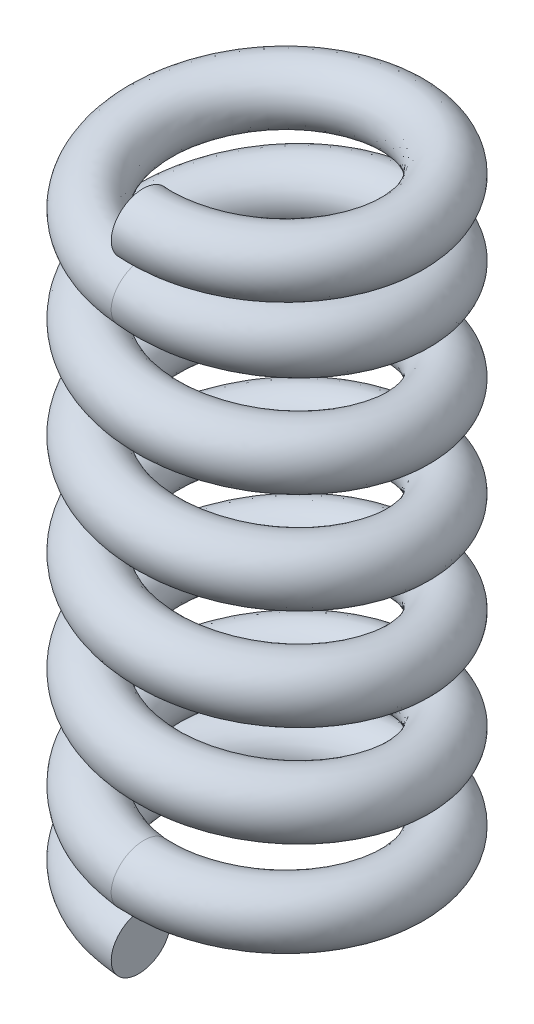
ISO-10303-21;
HEADER;
FILE_DESCRIPTION(('STEP AP214'),'2;1');
FILE_NAME('part.step','',(''),(''),'','','');
FILE_SCHEMA(('AUTOMOTIVE_DESIGN { 1 0 10303 214 1 1 1 1 }'));
ENDSEC;
DATA;
#1=APPLICATION_CONTEXT('core data for automotive mechanical design processes');
#2=APPLICATION_PROTOCOL_DEFINITION('international standard','automotive_design',2000,#1);
#3=PRODUCT_CONTEXT('',#1,'mechanical');
#4=PRODUCT('Part','Part','',(#3));
#5=PRODUCT_RELATED_PRODUCT_CATEGORY('part','',(#4));
#6=PRODUCT_DEFINITION_FORMATION('','',#4);
#7=PRODUCT_DEFINITION_CONTEXT('part definition',#1,'design');
#8=PRODUCT_DEFINITION('design','',#6,#7);
#9=PRODUCT_DEFINITION_SHAPE('','',#8);
#10=(LENGTH_UNIT() NAMED_UNIT(*) SI_UNIT(.MILLI.,.METRE.));
#11=(NAMED_UNIT(*) PLANE_ANGLE_UNIT() SI_UNIT($,.RADIAN.));
#12=(NAMED_UNIT(*) SI_UNIT($,.STERADIAN.) SOLID_ANGLE_UNIT());
#13=UNCERTAINTY_MEASURE_WITH_UNIT(LENGTH_MEASURE(1.E-05),#10,'distance_accuracy_value','');
#14=(GEOMETRIC_REPRESENTATION_CONTEXT(3) GLOBAL_UNCERTAINTY_ASSIGNED_CONTEXT((#13)) GLOBAL_UNIT_ASSIGNED_CONTEXT((#10,
#11,#12)) REPRESENTATION_CONTEXT('',''));
#15=CARTESIAN_POINT('',(0.,0.,0.));
#16=DIRECTION('',(0.,0.,1.));
#17=DIRECTION('',(1.,0.,0.));
#18=AXIS2_PLACEMENT_3D('',#15,#16,#17);
#19=CARTESIAN_POINT('',(0.0743138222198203,-1.00777902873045,4.25));
#20=CARTESIAN_POINT('',(-0.203525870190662,-0.986988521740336,4.23880103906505));
#21=CARTESIAN_POINT('',(-0.760276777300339,-0.945327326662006,4.21635992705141));
#22=CARTESIAN_POINT('',(-1.56743656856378,-0.882811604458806,3.97870692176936));
#23=CARTESIAN_POINT('',(-2.31417421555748,-0.820253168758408,3.59817667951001));
#24=CARTESIAN_POINT('',(-3.0444105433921,-0.750886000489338,3.02004700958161));
#25=CARTESIAN_POINT('',(-3.68508888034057,-0.674449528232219,2.21429245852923));
#26=CARTESIAN_POINT('',(-4.13240470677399,-0.591103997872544,1.18511764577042));
#27=CARTESIAN_POINT('',(-4.29892009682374,-0.507780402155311,0.0751959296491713));
#28=CARTESIAN_POINT('',(-4.1715287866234,-0.424452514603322,-1.03996572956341));
#29=CARTESIAN_POINT('',(-3.76004737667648,-0.341105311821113,-2.08406862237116));
#30=CARTESIAN_POINT('',(-3.09294836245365,-0.257780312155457,-2.98659687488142));
#31=CARTESIAN_POINT('',(-2.21435522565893,-0.17445154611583,-3.68509209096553));
#32=CARTESIAN_POINT('',(-1.18509634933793,-0.0911060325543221,-4.13241630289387));
#33=CARTESIAN_POINT('',(-0.0752014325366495,-0.00778011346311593,-4.29888283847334));
#34=CARTESIAN_POINT('',(1.03996780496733,0.0755484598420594,-4.17154066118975));
#35=CARTESIAN_POINT('',(2.08407066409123,0.158893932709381,-3.76005013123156));
#36=CARTESIAN_POINT('',(2.98658922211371,0.242220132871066,-3.09293888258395));
#37=CARTESIAN_POINT('',(3.68510247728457,0.325547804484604,-2.21436507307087));
#38=CARTESIAN_POINT('',(4.13241540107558,0.408894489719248,-1.18509102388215));
#39=CARTESIAN_POINT('',(4.29881735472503,0.492221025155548,-0.0752075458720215));
#40=CARTESIAN_POINT('',(4.17167429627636,0.57554554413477,1.0400159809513));
#41=CARTESIAN_POINT('',(3.75997068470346,0.658893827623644,2.08399843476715));
#42=CARTESIAN_POINT('',(3.14808480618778,0.735315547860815,2.91152523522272));
#43=CARTESIAN_POINT('',(2.43825669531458,0.804730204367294,3.51526181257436));
#44=CARTESIAN_POINT('',(1.70735151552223,0.867127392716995,3.92177429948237));
#45=CARTESIAN_POINT('',(0.902323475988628,0.930128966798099,4.1864863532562));
#46=CARTESIAN_POINT('',(0.366749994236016,0.970292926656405,4.22877042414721));
#47=CARTESIAN_POINT('',(0.100060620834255,0.990292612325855,4.24982582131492));
#48=CARTESIAN_POINT('',(0.0743138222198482,-1.00777902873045,6.24));
#49=CARTESIAN_POINT('',(-0.333850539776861,-0.987007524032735,6.22132138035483));
#50=CARTESIAN_POINT('',(-1.15175339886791,-0.945384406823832,6.18389210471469));
#51=CARTESIAN_POINT('',(-2.3315515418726,-0.882476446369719,5.82910257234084));
#52=CARTESIAN_POINT('',(-3.42750035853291,-0.819808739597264,5.26354968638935));
#53=CARTESIAN_POINT('',(-4.49482609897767,-0.750937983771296,4.40771714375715));
#54=CARTESIAN_POINT('',(-5.42719189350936,-0.674698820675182,3.22274478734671));
#55=CARTESIAN_POINT('',(-6.07730629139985,-0.590445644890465,1.7045487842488));
#56=CARTESIAN_POINT('',(-6.31148962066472,-0.5077009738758,0.0751157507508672));
#57=CARTESIAN_POINT('',(-6.11635315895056,-0.424612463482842,-1.55939584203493));
#58=CARTESIAN_POINT('',(-5.5025784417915,-0.340576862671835,-3.0919126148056));
#59=CARTESIAN_POINT('',(-4.51607524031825,-0.257618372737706,-4.40971145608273));
#60=CARTESIAN_POINT('',(-3.22221306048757,-0.174614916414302,-5.42761036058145));
#61=CARTESIAN_POINT('',(-1.70460809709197,-0.0905929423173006,-6.07721835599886));
#62=CARTESIAN_POINT('',(-0.075213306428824,-0.00760642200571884,-6.31148129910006));
#63=CARTESIAN_POINT('',(1.55945282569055,0.0753827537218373,-6.11634966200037));
#64=CARTESIAN_POINT('',(3.09190470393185,0.159404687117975,-5.50258238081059));
#65=CARTESIAN_POINT('',(4.40969930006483,0.242405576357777,-4.51607024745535));
#66=CARTESIAN_POINT('',(5.42761954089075,0.325366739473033,-3.22223294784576));
#67=CARTESIAN_POINT('',(6.07723279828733,0.409401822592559,-1.70454775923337));
#68=CARTESIAN_POINT('',(6.31138708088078,0.492488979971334,-0.0753115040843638));
#69=CARTESIAN_POINT('',(6.11658203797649,0.575234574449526,1.55941997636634));
#70=CARTESIAN_POINT('',(5.50209097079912,0.659490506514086,3.09242750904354));
#71=CARTESIAN_POINT('',(4.59850504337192,0.735714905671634,4.2991777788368));
#72=CARTESIAN_POINT('',(3.5516388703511,0.804633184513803,5.1806187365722));
#73=CARTESIAN_POINT('',(2.47136527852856,0.867139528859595,5.77216308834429));
#74=CARTESIAN_POINT('',(1.29482346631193,0.930533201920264,6.15383616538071));
#75=CARTESIAN_POINT('',(0.497248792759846,0.97065875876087,6.21124099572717));
#76=CARTESIAN_POINT('',(0.100095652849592,0.990639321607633,6.23982579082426));
#77=CARTESIAN_POINT('',(-0.0743138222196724,-2.99222097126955,6.24));
#78=CARTESIAN_POINT('',(-0.481905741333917,-2.97145002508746,6.21157263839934));
#79=CARTESIAN_POINT('',(-1.29866150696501,-2.92982802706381,6.15460828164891));
#80=CARTESIAN_POINT('',(-2.46993349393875,-2.86691212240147,5.77232051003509));
#81=CARTESIAN_POINT('',(-3.55210213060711,-2.80425417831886,5.18078523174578));
#82=CARTESIAN_POINT('',(-4.59847361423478,-2.73537899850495,4.2993133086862));
#83=CARTESIAN_POINT('',(-5.50227193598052,-2.65913973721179,3.0925401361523));
#84=CARTESIAN_POINT('',(-6.11673307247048,-2.57488837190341,1.55949627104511));
#85=CARTESIAN_POINT('',(-6.31156638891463,-2.49214094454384,-0.0752931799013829));
#86=CARTESIAN_POINT('',(-6.07740926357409,-2.40905472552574,-1.70456400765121));
#87=CARTESIAN_POINT('',(-5.42778826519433,-2.32501952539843,-3.22229502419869));
#88=CARTESIAN_POINT('',(-4.40983662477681,-2.24205778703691,-4.51618187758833));
#89=CARTESIAN_POINT('',(-3.09201887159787,-2.15905753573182,-5.5027191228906));
#90=CARTESIAN_POINT('',(-1.55952784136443,-2.07503554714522,-6.11651277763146));
#91=CARTESIAN_POINT('',(0.0751950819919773,-1.99204578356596,-6.31165735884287));
#92=CARTESIAN_POINT('',(1.70462401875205,-1.90905990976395,-6.07739578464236));
#93=CARTESIAN_POINT('',(3.22227542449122,-1.8250378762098,-5.42777872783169));
#94=CARTESIAN_POINT('',(4.51618674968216,-1.74203382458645,-4.40984881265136));
#95=CARTESIAN_POINT('',(5.50271539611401,-1.65907602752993,-3.09202703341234));
#96=CARTESIAN_POINT('',(6.11651513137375,-1.57504022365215,-1.55947053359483));
#97=CARTESIAN_POINT('',(6.31167027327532,-1.4919515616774,0.075097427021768));
#98=CARTESIAN_POINT('',(6.07746657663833,-1.4092060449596,1.70456336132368));
#99=CARTESIAN_POINT('',(5.42742516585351,-1.32495851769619,3.22280900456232));
#100=CARTESIAN_POINT('',(4.49474658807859,-1.24869875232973,4.40782351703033));
#101=CARTESIAN_POINT('',(3.42822200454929,-1.17988644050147,5.26367729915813));
#102=CARTESIAN_POINT('',(2.3293812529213,-1.11701639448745,5.82925962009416));
#103=CARTESIAN_POINT('',(1.16192121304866,-1.05495323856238,6.1835387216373));
#104=CARTESIAN_POINT('',(0.319472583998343,-1.01155573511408,6.22134731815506));
#105=CARTESIAN_POINT('',(-0.100025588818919,-0.989945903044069,6.24017414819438));
#106=CARTESIAN_POINT('',(-0.0743138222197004,-2.99222097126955,4.25));
#107=CARTESIAN_POINT('',(-0.351581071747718,-2.97143102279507,4.22905229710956));
#108=CARTESIAN_POINT('',(-0.907184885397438,-2.92977094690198,4.18707610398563));
#109=CARTESIAN_POINT('',(-1.70581852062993,-2.86724728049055,3.9219248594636));
#110=CARTESIAN_POINT('',(-2.43877598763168,-2.80469860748,3.51541222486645));
#111=CARTESIAN_POINT('',(-3.14805805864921,-2.73532701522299,2.91164317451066));
#112=CARTESIAN_POINT('',(-3.76016892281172,-2.65889044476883,2.08408780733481));
#113=CARTESIAN_POINT('',(-4.17183148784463,-2.57554672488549,1.04006513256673));
#114=CARTESIAN_POINT('',(-4.29899686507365,-2.49222037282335,-0.0752130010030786));
#115=CARTESIAN_POINT('',(-4.13258489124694,-2.40889477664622,-1.1851338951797));
#116=CARTESIAN_POINT('',(-3.68525720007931,-2.32554797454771,-2.21445103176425));
#117=CARTESIAN_POINT('',(-2.98670974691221,-2.24221972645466,-3.09306729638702));
#118=CARTESIAN_POINT('',(-2.08416103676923,-2.15889416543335,-3.76020085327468));
#119=CARTESIAN_POINT('',(-1.04001609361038,-2.07554863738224,-4.17171072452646));
#120=CARTESIAN_POINT('',(0.075206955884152,-1.99221947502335,-4.29905889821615));
#121=CARTESIAN_POINT('',(1.18513899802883,-1.90889420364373,-4.13258678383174));
#122=CARTESIAN_POINT('',(2.2144413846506,-1.8255486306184,-3.68524647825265));
#123=CARTESIAN_POINT('',(3.09307667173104,-1.74221926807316,-2.98671744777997));
#124=CARTESIAN_POINT('',(3.76019833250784,-1.65889496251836,-2.08415915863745));
#125=CARTESIAN_POINT('',(4.171697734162,-1.57554755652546,-1.04001379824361));
#126=CARTESIAN_POINT('',(4.29910054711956,-1.49221951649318,0.0752013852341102));
#127=CARTESIAN_POINT('',(4.13255883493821,-1.40889507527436,1.18515936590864));
#128=CARTESIAN_POINT('',(3.68530487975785,-1.32555519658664,2.21437993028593));
#129=CARTESIAN_POINT('',(3.04432635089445,-1.24909811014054,3.02017097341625));
#130=CARTESIAN_POINT('',(2.31483982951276,-1.17978942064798,3.59832037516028));
#131=CARTESIAN_POINT('',(1.56536748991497,-1.11702853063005,3.97887083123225));
#132=CARTESIAN_POINT('',(0.769421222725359,-1.05535747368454,4.21618890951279));
#133=CARTESIAN_POINT('',(0.188973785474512,-1.01192156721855,4.2388767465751));
#134=CARTESIAN_POINT('',(-0.100060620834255,-0.990292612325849,4.25017417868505));
#135=CARTESIAN_POINT('',(-0.0743138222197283,-2.99222097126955,2.26));
#136=CARTESIAN_POINT('',(-0.221256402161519,-2.97141202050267,2.24653195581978));
#137=CARTESIAN_POINT('',(-0.515708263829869,-2.92971386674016,2.21954392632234));
#138=CARTESIAN_POINT('',(-0.9417035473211,-2.86758243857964,2.07152920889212));
#139=CARTESIAN_POINT('',(-1.32544984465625,-2.80514303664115,1.85003921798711));
#140=CARTESIAN_POINT('',(-1.69764250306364,-2.73527503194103,1.52397304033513));
#141=CARTESIAN_POINT('',(-2.01806590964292,-2.65864115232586,1.07563547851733));
#142=CARTESIAN_POINT('',(-2.22692990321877,-2.57620507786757,0.520633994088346));
#143=CARTESIAN_POINT('',(-2.28642734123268,-2.49229980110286,-0.0751328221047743));
#144=CARTESIAN_POINT('',(-2.18776051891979,-2.4087348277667,-0.665703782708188));
#145=CARTESIAN_POINT('',(-1.94272613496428,-2.32607642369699,-1.20660703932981));
#146=CARTESIAN_POINT('',(-1.56358286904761,-2.24238166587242,-1.66995271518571));
#147=CARTESIAN_POINT('',(-1.07630320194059,-2.15873079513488,-2.01768258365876));
#148=CARTESIAN_POINT('',(-0.520504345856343,-2.07606172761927,-2.22690867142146));
#149=CARTESIAN_POINT('',(0.0752188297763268,-1.99239316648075,-2.28646043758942));
#150=CARTESIAN_POINT('',(0.665653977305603,-1.90872849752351,-2.18777778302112));
#151=CARTESIAN_POINT('',(1.20660734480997,-1.82605938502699,-1.94271422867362));
#152=CARTESIAN_POINT('',(1.66996659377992,-1.74240471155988,-1.56358608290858));
#153=CARTESIAN_POINT('',(2.01768126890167,-1.65871389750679,-1.07629128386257));
#154=CARTESIAN_POINT('',(2.22688033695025,-1.57605488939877,-0.520557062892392));
#155=CARTESIAN_POINT('',(2.28653082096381,-1.49248747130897,0.0753053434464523));
#156=CARTESIAN_POINT('',(2.18765109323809,-1.40858410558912,0.665755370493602));
#157=CARTESIAN_POINT('',(1.94318459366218,-1.32615187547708,1.20595085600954));
#158=CARTESIAN_POINT('',(1.59390611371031,-1.24949746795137,1.63251842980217));
#159=CARTESIAN_POINT('',(1.20145765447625,-1.17969240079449,1.93296345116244));
#160=CARTESIAN_POINT('',(0.801353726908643,-1.11704066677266,2.12848204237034));
#161=CARTESIAN_POINT('',(0.376921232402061,-1.05576170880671,2.24883909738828));
#162=CARTESIAN_POINT('',(0.0584749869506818,-1.01228739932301,2.25640617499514));
#163=CARTESIAN_POINT('',(-0.100095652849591,-0.990639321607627,2.26017420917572));
#164=CARTESIAN_POINT('',(0.0743138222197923,-1.00777902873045,2.26));
#165=CARTESIAN_POINT('',(-0.0732012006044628,-0.986969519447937,2.25628069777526));
#166=CARTESIAN_POINT('',(-0.36880015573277,-0.945270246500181,2.24882774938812));
#167=CARTESIAN_POINT('',(-0.803321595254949,-0.883146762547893,2.12831127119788));
#168=CARTESIAN_POINT('',(-1.20084807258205,-0.820697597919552,1.93280367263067));
#169=CARTESIAN_POINT('',(-1.59399498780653,-0.750834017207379,1.63237687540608));
#170=CARTESIAN_POINT('',(-1.94298586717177,-0.674200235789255,1.20584012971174));
#171=CARTESIAN_POINT('',(-2.18750312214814,-0.591762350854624,0.665686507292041));
#172=CARTESIAN_POINT('',(-2.28635057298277,-0.507859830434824,0.0752761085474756));
#173=CARTESIAN_POINT('',(-2.22670441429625,-0.424292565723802,-0.520535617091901));
#174=CARTESIAN_POINT('',(-2.01751631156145,-0.341633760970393,-1.07622462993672));
#175=CARTESIAN_POINT('',(-1.66982148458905,-0.257942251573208,-1.5634822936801));
#176=CARTESIAN_POINT('',(-1.20649739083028,-0.174288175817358,-1.94257382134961));
#177=CARTESIAN_POINT('',(-0.665584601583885,-0.0916191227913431,-2.18761424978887));
#178=CARTESIAN_POINT('',(-0.0751895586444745,-0.00795380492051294,-2.28628437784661));
#179=CARTESIAN_POINT('',(0.520482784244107,0.0757141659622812,-2.22673166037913));
#180=CARTESIAN_POINT('',(1.0762366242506,0.158383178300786,-2.01751788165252));
#181=CARTESIAN_POINT('',(1.56347914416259,0.242034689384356,-1.66980751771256));
#182=CARTESIAN_POINT('',(1.94258541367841,0.325728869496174,-1.20649719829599));
#183=CARTESIAN_POINT('',(2.18759800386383,0.408387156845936,-0.665634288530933));
#184=CARTESIAN_POINT('',(2.28624762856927,0.491953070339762,-0.0751035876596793));
#185=CARTESIAN_POINT('',(2.22676655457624,0.575856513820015,0.520611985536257));
#186=CARTESIAN_POINT('',(2.01785039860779,0.658297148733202,1.07556936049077));
#187=CARTESIAN_POINT('',(1.69766456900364,0.734916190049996,1.52387269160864));
#188=CARTESIAN_POINT('',(1.32487452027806,0.804827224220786,1.84990488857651));
#189=CARTESIAN_POINT('',(0.943337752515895,0.867115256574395,2.07138551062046));
#190=CARTESIAN_POINT('',(0.509823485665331,0.929724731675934,2.21913654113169));
#191=CARTESIAN_POINT('',(0.236251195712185,0.96992709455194,2.24629985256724));
#192=CARTESIAN_POINT('',(0.100025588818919,0.989945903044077,2.25982585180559));
#193=CARTESIAN_POINT('',(0.0743138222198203,-1.00777902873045,4.25));
#194=CARTESIAN_POINT('',(-0.203525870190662,-0.986988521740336,4.23880103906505));
#195=CARTESIAN_POINT('',(-0.760276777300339,-0.945327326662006,4.21635992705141));
#196=CARTESIAN_POINT('',(-1.56743656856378,-0.882811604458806,3.97870692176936));
#197=CARTESIAN_POINT('',(-2.31417421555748,-0.820253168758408,3.59817667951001));
#198=CARTESIAN_POINT('',(-3.0444105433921,-0.750886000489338,3.02004700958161));
#199=CARTESIAN_POINT('',(-3.68508888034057,-0.674449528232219,2.21429245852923));
#200=CARTESIAN_POINT('',(-4.13240470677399,-0.591103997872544,1.18511764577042));
#201=CARTESIAN_POINT('',(-4.29892009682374,-0.507780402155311,0.0751959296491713));
#202=CARTESIAN_POINT('',(-4.1715287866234,-0.424452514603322,-1.03996572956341));
#203=CARTESIAN_POINT('',(-3.76004737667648,-0.341105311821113,-2.08406862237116));
#204=CARTESIAN_POINT('',(-3.09294836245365,-0.257780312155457,-2.98659687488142));
#205=CARTESIAN_POINT('',(-2.21435522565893,-0.17445154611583,-3.68509209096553));
#206=CARTESIAN_POINT('',(-1.18509634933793,-0.0911060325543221,-4.13241630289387));
#207=CARTESIAN_POINT('',(-0.0752014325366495,-0.00778011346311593,-4.29888283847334));
#208=CARTESIAN_POINT('',(1.03996780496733,0.0755484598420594,-4.17154066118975));
#209=CARTESIAN_POINT('',(2.08407066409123,0.158893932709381,-3.76005013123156));
#210=CARTESIAN_POINT('',(2.98658922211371,0.242220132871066,-3.09293888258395));
#211=CARTESIAN_POINT('',(3.68510247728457,0.325547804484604,-2.21436507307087));
#212=CARTESIAN_POINT('',(4.13241540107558,0.408894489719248,-1.18509102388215));
#213=CARTESIAN_POINT('',(4.29881735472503,0.492221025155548,-0.0752075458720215));
#214=CARTESIAN_POINT('',(4.17167429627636,0.57554554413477,1.0400159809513));
#215=CARTESIAN_POINT('',(3.75997068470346,0.658893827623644,2.08399843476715));
#216=CARTESIAN_POINT('',(3.14808480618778,0.735315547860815,2.91152523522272));
#217=CARTESIAN_POINT('',(2.43825669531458,0.804730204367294,3.51526181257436));
#218=CARTESIAN_POINT('',(1.70735151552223,0.867127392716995,3.92177429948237));
#219=CARTESIAN_POINT('',(0.902323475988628,0.930128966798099,4.1864863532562));
#220=CARTESIAN_POINT('',(0.366749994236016,0.970292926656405,4.22877042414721));
#221=CARTESIAN_POINT('',(0.100060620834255,0.990292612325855,4.24982582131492));
#222=(BOUNDED_SURFACE() B_SPLINE_SURFACE(3,3,((#19,#20,#21,#22,#23,#24,#25,#26,#27,#28,#29,#30,
#31,#32,#33,#34,#35,#36,#37,#38,#39,#40,#41,#42,#43,#44,#45,#46,#47),(#48,#49,#50,#51,#52,#53,
#54,#55,#56,#57,#58,#59,#60,#61,#62,#63,#64,#65,#66,#67,#68,#69,#70,#71,#72,#73,#74,#75,#76),
(#77,#78,#79,#80,#81,#82,#83,#84,#85,#86,#87,#88,#89,#90,#91,#92,#93,#94,#95,#96,#97,#98,#99,
#100,#101,#102,#103,#104,#105),(#106,#107,#108,#109,#110,#111,#112,#113,#114,#115,#116,#117,
#118,#119,#120,#121,#122,#123,#124,#125,#126,#127,#128,#129,#130,#131,#132,#133,#134),(#135,
#136,#137,#138,#139,#140,#141,#142,#143,#144,#145,#146,#147,#148,#149,#150,#151,#152,#153,#154,
#155,#156,#157,#158,#159,#160,#161,#162,#163),(#164,#165,#166,#167,#168,#169,#170,#171,#172,
#173,#174,#175,#176,#177,#178,#179,#180,#181,#182,#183,#184,#185,#186,#187,#188,#189,#190,#191,
#192),(#193,#194,#195,#196,#197,#198,#199,#200,#201,#202,#203,#204,#205,#206,#207,#208,#209,
#210,#211,#212,#213,#214,#215,#216,#217,#218,#219,#220,#221)),.UNSPECIFIED.,.T.,.F.,
.F.) B_SPLINE_SURFACE_WITH_KNOTS((4,3,4),(4,1,1,1,1,1,1,1,1,1,1,1,1,1,1,1,1,1,1,1,1,1,1,1,1,1,
4),(0.,0.5,1.),(0.,0.0312218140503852,0.0625640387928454,0.0938623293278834,0.125133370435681,
0.166792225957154,0.208450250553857,0.250111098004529,0.29177209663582,0.333428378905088,
0.375089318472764,0.416750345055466,0.458406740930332,0.500067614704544,0.541728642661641,
0.583385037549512,0.625045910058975,0.666707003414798,0.708363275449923,0.750024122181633,
0.791685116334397,0.833343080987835,0.875001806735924,0.906272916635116,0.937571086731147,
0.968913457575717,1.),
.UNSPECIFIED.) GEOMETRIC_REPRESENTATION_ITEM() RATIONAL_B_SPLINE_SURFACE(((1.,1.,1.,1.,1.,1.,1.,
1.,1.,1.,1.,1.,1.,1.,1.,1.,1.,1.,1.,1.,1.,1.,1.,1.,1.,1.,1.,1.,1.),(0.333333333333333,
0.333333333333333,0.333333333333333,0.333333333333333,0.333333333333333,0.333333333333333,
0.333333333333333,0.333333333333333,0.333333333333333,0.333333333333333,0.333333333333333,
0.333333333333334,0.333333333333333,0.333333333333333,0.333333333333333,0.333333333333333,
0.333333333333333,0.333333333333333,0.333333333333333,0.333333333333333,0.333333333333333,
0.333333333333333,0.333333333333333,0.333333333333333,0.333333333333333,0.333333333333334,
0.333333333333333,0.333333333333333,0.333333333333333),(0.333333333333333,0.333333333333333,
0.333333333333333,0.333333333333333,0.333333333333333,0.333333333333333,0.333333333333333,
0.333333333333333,0.333333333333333,0.333333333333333,0.333333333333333,0.333333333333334,
0.333333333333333,0.333333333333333,0.333333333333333,0.333333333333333,0.333333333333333,
0.333333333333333,0.333333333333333,0.333333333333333,0.333333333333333,0.333333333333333,
0.333333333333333,0.333333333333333,0.333333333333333,0.333333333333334,0.333333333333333,
0.333333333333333,0.333333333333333),(1.,1.,1.,1.,1.,1.,1.,1.,1.,1.,1.,1.,1.,1.,1.,1.,1.,1.,1.,
1.,1.,1.,1.,1.,1.,1.,1.,1.,1.),(0.333333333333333,0.333333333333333,0.333333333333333,
0.333333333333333,0.333333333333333,0.333333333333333,0.333333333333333,0.333333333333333,
0.333333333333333,0.333333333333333,0.333333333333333,0.333333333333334,0.333333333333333,
0.333333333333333,0.333333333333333,0.333333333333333,0.333333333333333,0.333333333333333,
0.333333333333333,0.333333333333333,0.333333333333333,0.333333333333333,0.333333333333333,
0.333333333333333,0.333333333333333,0.333333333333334,0.333333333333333,0.333333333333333,
0.333333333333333),(0.333333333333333,0.333333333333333,0.333333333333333,0.333333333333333,
0.333333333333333,0.333333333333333,0.333333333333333,0.333333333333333,0.333333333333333,
0.333333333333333,0.333333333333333,0.333333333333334,0.333333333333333,0.333333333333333,
0.333333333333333,0.333333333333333,0.333333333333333,0.333333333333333,0.333333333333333,
0.333333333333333,0.333333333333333,0.333333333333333,0.333333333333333,0.333333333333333,
0.333333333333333,0.333333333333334,0.333333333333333,0.333333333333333,0.333333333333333),(1.,
1.,1.,1.,1.,1.,1.,1.,1.,1.,1.,1.,1.,1.,1.,1.,1.,1.,1.,1.,1.,1.,1.,1.,1.,1.,1.,1.,1.))) REPRESENTATION_ITEM('') SURFACE());
#223=CARTESIAN_POINT('',(0.,-2.,4.25));
#224=DIRECTION('',(0.997207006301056,-0.0746872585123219,0.));
#225=DIRECTION('',(0.0746872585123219,0.997207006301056,0.));
#226=AXIS2_PLACEMENT_3D('',#223,#224,#225);
#227=CIRCLE('',#226,0.995);
#228=CARTESIAN_POINT('',(0.0743138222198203,-1.00777902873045,4.25));
#229=VERTEX_POINT('',#228);
#230=EDGE_CURVE('E10',#229,#229,#227,.T.);
#231=CARTESIAN_POINT('',(0.100060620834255,0.990292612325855,4.24982582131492));
#232=CARTESIAN_POINT('',(0.100095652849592,0.990639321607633,6.23982579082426));
#233=CARTESIAN_POINT('',(-0.100025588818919,-0.989945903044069,6.24017414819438));
#234=CARTESIAN_POINT('',(-0.100060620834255,-0.990292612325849,4.25017417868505));
#235=CARTESIAN_POINT('',(-0.100095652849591,-0.990639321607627,2.26017420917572));
#236=CARTESIAN_POINT('',(0.100025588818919,0.989945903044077,2.25982585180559));
#237=CARTESIAN_POINT('',(0.100060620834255,0.990292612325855,4.24982582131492));
#238=(BOUNDED_CURVE() B_SPLINE_CURVE(3,(#231,#232,#233,#234,#235,#236,#237),.UNSPECIFIED.,.T.,
.F.) B_SPLINE_CURVE_WITH_KNOTS((4,3,4),(0.,0.5,1.),
.UNSPECIFIED.) CURVE() GEOMETRIC_REPRESENTATION_ITEM() RATIONAL_B_SPLINE_CURVE((1.,
0.333333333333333,0.333333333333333,1.,0.333333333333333,0.333333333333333,1.)) REPRESENTATION_ITEM(''));
#239=CARTESIAN_POINT('',(0.100060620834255,0.990292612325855,4.24982582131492));
#240=VERTEX_POINT('',#239);
#241=EDGE_CURVE('E42',#240,#240,#238,.F.);
#242=ORIENTED_EDGE('',*,*,#230,.F.);
#243=EDGE_LOOP('',(#242));
#244=FACE_BOUND('',#243,.T.);
#245=ORIENTED_EDGE('',*,*,#241,.F.);
#246=EDGE_LOOP('',(#245));
#247=FACE_BOUND('',#246,.T.);
#248=ADVANCED_FACE('F34',(#244,#247),#222,.F.);
#249=CARTESIAN_POINT('',(0.,-2.,4.25));
#250=DIRECTION('',(0.997207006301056,-0.0746872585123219,0.));
#251=DIRECTION('',(0.0746872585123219,0.997207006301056,0.));
#252=AXIS2_PLACEMENT_3D('',#249,#250,#251);
#253=PLANE('',#252);
#254=ORIENTED_EDGE('',*,*,#230,.T.);
#255=EDGE_LOOP('',(#254));
#256=FACE_BOUND('',#255,.T.);
#257=ADVANCED_FACE('F80',(#256),#253,.T.);
#258=CARTESIAN_POINT('',(0.100060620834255,0.990292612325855,4.24982582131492));
#259=CARTESIAN_POINT('',(-0.246467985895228,1.03441400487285,4.24982582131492));
#260=CARTESIAN_POINT('',(-0.910138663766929,1.11859831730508,4.19853040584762));
#261=CARTESIAN_POINT('',(-1.91399109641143,1.2530173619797,3.84412573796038));
#262=CARTESIAN_POINT('',(-2.78826705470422,1.38537975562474,3.26644915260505));
#263=CARTESIAN_POINT('',(-3.49843155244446,1.51829397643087,2.4899597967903));
#264=CARTESIAN_POINT('',(-3.99857574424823,1.65110125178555,1.56562782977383));
#265=CARTESIAN_POINT('',(-4.25961489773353,1.78389487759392,0.547097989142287));
#266=CARTESIAN_POINT('',(-4.26418806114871,1.9167277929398,-0.504243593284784));
#267=CARTESIAN_POINT('',(-4.0145535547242,2.04952898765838,-1.52541784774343));
#268=CARTESIAN_POINT('',(-3.52327021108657,2.18233479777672,-2.45503181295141));
#269=CARTESIAN_POINT('',(-2.82101870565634,2.31517171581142,-3.23732721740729));
#270=CARTESIAN_POINT('',(-1.95023297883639,2.44795499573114,-3.82639757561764));
#271=CARTESIAN_POINT('',(-0.961796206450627,2.58078370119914,-4.18488741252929));
#272=CARTESIAN_POINT('',(0.0837923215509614,2.71360308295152,-4.29346305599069));
#273=CARTESIAN_POINT('',(1.12461181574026,2.84639012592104,-4.14469516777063));
#274=CARTESIAN_POINT('',(2.09768853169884,2.97923162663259,-3.74661820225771));
#275=CARTESIAN_POINT('',(2.9456203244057,3.11202801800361,-3.12523012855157));
#276=CARTESIAN_POINT('',(3.61644988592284,3.24483430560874,-2.31557471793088));
#277=CARTESIAN_POINT('',(4.07045353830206,3.37767213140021,-1.36740863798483));
#278=CARTESIAN_POINT('',(4.28145406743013,3.51045496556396,-0.337481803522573));
#279=CARTESIAN_POINT('',(4.23439568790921,3.64328362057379,0.712903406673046));
#280=CARTESIAN_POINT('',(3.93457613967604,3.77610312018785,1.72045099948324));
#281=CARTESIAN_POINT('',(3.39882882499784,3.90889012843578,2.62511203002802));
#282=CARTESIAN_POINT('',(2.65867326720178,4.04173161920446,3.37178027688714));
#283=CARTESIAN_POINT('',(1.76009602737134,4.17452802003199,3.91737207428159));
#284=CARTESIAN_POINT('',(0.755356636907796,4.30733430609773,4.22729611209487));
#285=CARTESIAN_POINT('',(-0.294374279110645,4.44017213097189,4.28389334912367));
#286=CARTESIAN_POINT('',(-1.32664900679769,4.5729549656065,4.08469647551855));
#287=CARTESIAN_POINT('',(-2.27906994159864,4.70578362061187,3.63925518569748));
#288=CARTESIAN_POINT('',(-3.09518656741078,4.83860312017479,2.97668627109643));
#289=CARTESIAN_POINT('',(-3.72596275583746,4.97139012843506,2.13552150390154));
#290=CARTESIAN_POINT('',(-4.13254899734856,5.1042316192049,1.16596936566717));
#291=CARTESIAN_POINT('',(-4.29273946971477,5.23702802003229,0.127003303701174));
#292=CARTESIAN_POINT('',(-4.19457482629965,5.36983430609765,-0.919857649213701));
#293=CARTESIAN_POINT('',(-3.84514922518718,5.5026721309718,-1.91134138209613));
#294=CARTESIAN_POINT('',(-3.26608087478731,5.63545496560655,-2.78880953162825));
#295=CARTESIAN_POINT('',(-2.49007107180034,5.76828362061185,-3.49826873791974));
#296=CARTESIAN_POINT('',(-1.56562290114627,5.90110312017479,-3.9987080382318));
#297=CARTESIAN_POINT('',(-0.547100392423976,6.03389012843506,-4.25956942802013));
#298=CARTESIAN_POINT('',(0.504242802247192,6.16673161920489,-4.26417459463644));
#299=CARTESIAN_POINT('',(1.52542452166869,6.29952802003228,-4.01457619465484));
#300=CARTESIAN_POINT('',(2.45503194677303,6.43233430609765,-3.52326754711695));
#301=CARTESIAN_POINT('',(3.23732408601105,6.5651721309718,-2.82101598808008));
#302=CARTESIAN_POINT('',(3.82639908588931,6.69795496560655,-1.95023406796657));
#303=CARTESIAN_POINT('',(4.18488783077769,6.83078362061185,-0.961796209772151));
#304=CARTESIAN_POINT('',(4.29346245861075,6.96360312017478,0.0837923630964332));
#305=CARTESIAN_POINT('',(4.14469526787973,7.09639012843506,1.12461179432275));
#306=CARTESIAN_POINT('',(3.74661826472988,7.22923161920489,2.09768857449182));
#307=CARTESIAN_POINT('',(3.1252300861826,7.36202802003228,2.94562029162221));
#308=CARTESIAN_POINT('',(2.31557472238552,7.49483430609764,3.61644988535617));
#309=CARTESIAN_POINT('',(1.36740863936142,7.62767213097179,4.07045354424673));
#310=CARTESIAN_POINT('',(0.337481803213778,7.76045496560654,4.2814540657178));
#311=CARTESIAN_POINT('',(-0.712903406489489,7.89328362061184,4.23439568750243));
#312=CARTESIAN_POINT('',(-1.72045099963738,8.02610312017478,3.93457614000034));
#313=CARTESIAN_POINT('',(-2.62511203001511,8.15889012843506,3.39882882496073));
#314=CARTESIAN_POINT('',(-3.37178027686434,8.29173161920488,2.65867326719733));
#315=CARTESIAN_POINT('',(-3.91737207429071,8.42452802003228,1.76009602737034));
#316=CARTESIAN_POINT('',(-4.22729611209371,8.55733430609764,0.755356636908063));
#317=CARTESIAN_POINT('',(-4.28389334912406,8.69017213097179,-0.294374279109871));
#318=CARTESIAN_POINT('',(-4.08469647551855,8.82295496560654,-1.32664900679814));
#319=CARTESIAN_POINT('',(-3.63925518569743,8.95578362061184,-2.27906994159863));
#320=CARTESIAN_POINT('',(-2.97668627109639,9.08860312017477,-3.09518656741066));
#321=CARTESIAN_POINT('',(-2.13552150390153,9.22139012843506,-3.72596275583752));
#322=CARTESIAN_POINT('',(-1.16596936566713,9.35423161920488,-4.13254899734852));
#323=CARTESIAN_POINT('',(-0.12700330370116,9.48702802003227,-4.29273946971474));
#324=CARTESIAN_POINT('',(0.919857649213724,9.61983430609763,-4.19457482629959));
#325=CARTESIAN_POINT('',(1.91134138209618,9.75267213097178,-3.8451492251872));
#326=CARTESIAN_POINT('',(2.78880953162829,9.88545496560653,-3.26608087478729));
#327=CARTESIAN_POINT('',(3.49826873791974,10.0182836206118,-2.49007107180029));
#328=CARTESIAN_POINT('',(3.99870803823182,10.1511031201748,-1.56562290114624));
#329=CARTESIAN_POINT('',(4.25956942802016,10.283890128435,-0.547100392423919));
#330=CARTESIAN_POINT('',(4.26417459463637,10.4167316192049,0.504242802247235));
#331=CARTESIAN_POINT('',(4.01457619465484,10.5495280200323,1.52542452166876));
#332=CARTESIAN_POINT('',(3.52326754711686,10.6823343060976,2.45503194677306));
#333=CARTESIAN_POINT('',(2.82101598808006,10.8151721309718,3.23732408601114));
#334=CARTESIAN_POINT('',(1.9502340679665,10.9479549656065,3.82639908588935));
#335=CARTESIAN_POINT('',(0.96179620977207,11.0807836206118,4.18488783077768));
#336=CARTESIAN_POINT('',(-0.0837923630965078,11.2136031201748,4.29346245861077));
#337=CARTESIAN_POINT('',(-1.12461179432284,11.346390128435,4.14469526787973));
#338=CARTESIAN_POINT('',(-2.09768857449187,11.4792316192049,3.74661826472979));
#339=CARTESIAN_POINT('',(-2.94562029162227,11.6120280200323,3.12523008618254));
#340=CARTESIAN_POINT('',(-3.61644988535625,11.7448343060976,2.31557472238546));
#341=CARTESIAN_POINT('',(-4.07045354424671,11.8776721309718,1.36740863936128));
#342=CARTESIAN_POINT('',(-4.28145406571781,12.0104549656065,0.337481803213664));
#343=CARTESIAN_POINT('',(-4.23439568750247,12.1432836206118,-0.712903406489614));
#344=CARTESIAN_POINT('',(-3.93457614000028,12.2761031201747,-1.72045099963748));
#345=CARTESIAN_POINT('',(-3.39882882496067,12.408890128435,-2.62511203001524));
#346=CARTESIAN_POINT('',(-2.65867326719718,12.5417316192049,-3.37178027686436));
#347=CARTESIAN_POINT('',(-1.76009602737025,12.6745280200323,-3.91737207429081));
#348=CARTESIAN_POINT('',(-0.755356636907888,12.8073343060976,-4.22729611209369));
#349=CARTESIAN_POINT('',(0.29437427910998,12.9401721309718,-4.28389334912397));
#350=CARTESIAN_POINT('',(1.32664900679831,13.0729549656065,-4.08469647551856));
#351=CARTESIAN_POINT('',(2.27906994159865,13.2057836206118,-3.63925518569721));
#352=CARTESIAN_POINT('',(3.09518656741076,13.3386031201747,-2.97668627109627));
#353=CARTESIAN_POINT('',(3.7259627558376,13.471390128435,-2.13552150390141));
#354=CARTESIAN_POINT('',(4.13254899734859,13.6042316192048,-1.16596936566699));
#355=CARTESIAN_POINT('',(4.2927394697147,13.7370280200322,-0.127003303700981));
#356=CARTESIAN_POINT('',(4.19457482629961,13.8698343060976,0.919857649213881));
#357=CARTESIAN_POINT('',(3.84514922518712,14.0026721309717,1.91134138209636));
#358=CARTESIAN_POINT('',(3.26608087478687,14.1354549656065,2.78880953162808));
#359=CARTESIAN_POINT('',(2.49007107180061,14.2682836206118,3.49826873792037));
#360=CARTESIAN_POINT('',(1.56562290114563,14.4011031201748,3.99870803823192));
#361=CARTESIAN_POINT('',(0.547100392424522,14.5338901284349,4.25956942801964));
#362=CARTESIAN_POINT('',(-0.504242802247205,14.6667316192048,4.26417459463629));
#363=CARTESIAN_POINT('',(-1.52542452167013,14.7995280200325,4.01457619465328));
#364=CARTESIAN_POINT('',(-2.45503194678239,14.9323343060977,3.52326754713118));
#365=CARTESIAN_POINT('',(-3.23732408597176,15.0651721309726,2.82101598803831));
#366=CARTESIAN_POINT('',(-3.82639908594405,15.1979549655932,1.950234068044));
#367=CARTESIAN_POINT('',(-4.18488783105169,15.3307836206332,0.961796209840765));
#368=CARTESIAN_POINT('',(-4.29346245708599,15.4636031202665,-0.0837923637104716));
#369=CARTESIAN_POINT('',(-4.14469527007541,15.5963901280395,-1.1246117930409));
#370=CARTESIAN_POINT('',(-3.74661827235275,15.7292316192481,-2.09768857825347));
#371=CARTESIAN_POINT('',(-3.12523004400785,15.8620280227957,-2.94562026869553));
#372=CARTESIAN_POINT('',(-2.31557476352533,15.9948342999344,-3.61644990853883));
#373=CARTESIAN_POINT('',(-1.36740870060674,16.1276721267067,-4.07045365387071));
#374=CARTESIAN_POINT('',(-0.337481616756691,16.2604550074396,-4.28145349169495));
#375=CARTESIAN_POINT('',(0.712903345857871,16.3932835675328,-4.23439610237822));
#376=CARTESIAN_POINT('',(1.7204514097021,16.5261030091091,-3.93457823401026));
#377=CARTESIAN_POINT('',(2.62510955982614,16.6588905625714,-3.39882337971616));
#378=CARTESIAN_POINT('',(3.37178023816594,16.7917313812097,-2.65867406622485));
#379=CARTESIAN_POINT('',(3.91739951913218,16.9245267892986,-1.76011199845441));
#380=CARTESIAN_POINT('',(4.22724994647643,17.0573367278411,-0.755341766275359));
#381=CARTESIAN_POINT('',(4.283870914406,17.1901735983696,0.294372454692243));
#382=CARTESIAN_POINT('',(4.08496311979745,17.3229405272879,1.32669910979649));
#383=CARTESIAN_POINT('',(3.63876844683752,17.4558228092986,2.2790132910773));
#384=CARTESIAN_POINT('',(2.97750377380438,17.5884903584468,3.0946728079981));
#385=CARTESIAN_POINT('',(2.13276419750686,17.7217768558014,3.72808770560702));
#386=CARTESIAN_POINT('',(1.17541827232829,17.8530221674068,4.12762599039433));
#387=CARTESIAN_POINT('',(0.446589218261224,17.9461711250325,4.24953126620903));
#388=CARTESIAN_POINT('',(0.1000606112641,17.9902925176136,4.24953126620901));
#389=CARTESIAN_POINT('',(0.100025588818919,0.989945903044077,2.25982585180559));
#390=CARTESIAN_POINT('',(-0.271977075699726,1.03731075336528,2.25982585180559));
#391=CARTESIAN_POINT('',(-0.334746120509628,1.11756792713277,2.24843462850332));
#392=CARTESIAN_POINT('',(-0.989372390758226,1.25133364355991,2.07162250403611));
#393=CARTESIAN_POINT('',(-1.43236695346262,1.38540538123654,1.77701134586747));
#394=CARTESIAN_POINT('',(-1.82895820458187,1.51801037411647,1.37266695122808));
#395=CARTESIAN_POINT('',(-2.10514775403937,1.64949036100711,0.889948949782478));
#396=CARTESIAN_POINT('',(-2.2595731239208,1.78412419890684,0.347954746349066));
#397=CARTESIAN_POINT('',(-2.27583477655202,1.91561363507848,-0.207959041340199));
#398=CARTESIAN_POINT('',(-2.15769996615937,2.04883670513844,-0.756391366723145));
#399=CARTESIAN_POINT('',(-1.90768771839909,2.18224722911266,-1.25872396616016));
#400=CARTESIAN_POINT('',(-1.54750871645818,2.31369786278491,-1.68217221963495));
#401=CARTESIAN_POINT('',(-1.08920906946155,2.44799348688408,-2.01029337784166));
#402=CARTESIAN_POINT('',(-0.569505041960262,2.58014506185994,-2.21313702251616));
#403=CARTESIAN_POINT('',(-0.0165349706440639,2.71228657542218,-2.28609433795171));
#404=CARTESIAN_POINT('',(0.543330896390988,2.84659803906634,-2.22051924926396));
#405=CARTESIAN_POINT('',(1.06302771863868,2.97804444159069,-2.02303844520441));
#406=CARTESIAN_POINT('',(1.52452970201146,3.11139035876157,-1.70402647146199));
#407=CARTESIAN_POINT('',(1.89295609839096,3.24474583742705,-1.28077057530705));
#408=CARTESIAN_POINT('',(2.14632509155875,3.37618846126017,-0.785970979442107));
#409=CARTESIAN_POINT('',(2.27409328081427,3.5104971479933,-0.236993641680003));
#410=CARTESIAN_POINT('',(2.26261245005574,3.64264585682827,0.320777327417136));
#411=CARTESIAN_POINT('',(2.11840287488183,3.77478541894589,0.859573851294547));
#412=CARTESIAN_POINT('',(1.84356861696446,3.90909826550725,1.35172829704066));
#413=CARTESIAN_POINT('',(1.46224076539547,4.04054454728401,1.75629289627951));
#414=CARTESIAN_POINT('',(0.990902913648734,4.17389026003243,2.06058443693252));
#415=CARTESIAN_POINT('',(0.458874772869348,4.30724584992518,2.23899307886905));
#416=CARTESIAN_POINT('',(-0.0952205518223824,4.43868846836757,2.28372389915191));
#417=CARTESIAN_POINT('',(-0.65130424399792,4.57299714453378,2.19168177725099));
#418=CARTESIAN_POINT('',(-1.16222390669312,4.70514585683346,1.96762516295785));
#419=CARTESIAN_POINT('',(-1.60482037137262,4.83728541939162,1.62820438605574));
#420=CARTESIAN_POINT('',(-1.9543372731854,4.97159826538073,1.18595128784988));
#421=CARTESIAN_POINT('',(-2.1821783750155,5.10304454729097,0.678830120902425));
#422=CARTESIAN_POINT('',(-2.28293391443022,5.23639026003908,0.126923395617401));
#423=CARTESIAN_POINT('',(-2.24416365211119,5.36974584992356,-0.432880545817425));
#424=CARTESIAN_POINT('',(-2.07344644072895,5.50118846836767,-0.961915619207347));
#425=CARTESIAN_POINT('',(-1.77560659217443,5.63549714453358,-1.4404469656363));
#426=CARTESIAN_POINT('',(-1.37308478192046,5.767645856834,-1.82673243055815));
#427=CARTESIAN_POINT('',(-0.890126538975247,5.89978541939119,-2.10574753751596));
#428=CARTESIAN_POINT('',(-0.347783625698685,6.03409826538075,-2.25941611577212));
#429=CARTESIAN_POINT('',(0.207926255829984,6.16554454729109,-2.27584697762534));
#430=CARTESIAN_POINT('',(0.756379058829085,6.29889026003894,-2.15772739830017));
#431=CARTESIAN_POINT('',(1.25873372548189,6.43224584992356,-1.90768065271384));
#432=CARTESIAN_POINT('',(1.68216775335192,6.56368846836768,-1.547505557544));
#433=CARTESIAN_POINT('',(2.01029469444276,6.69799714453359,-1.08921139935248));
#434=CARTESIAN_POINT('',(2.21313750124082,6.83014585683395,-0.569504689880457));
#435=CARTESIAN_POINT('',(2.28609372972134,6.96228541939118,-0.0165349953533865));
#436=CARTESIAN_POINT('',(2.22051933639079,7.0965982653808,0.543330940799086));
#437=CARTESIAN_POINT('',(2.0230385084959,7.22804454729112,1.06302774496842));
#438=CARTESIAN_POINT('',(1.70402644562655,7.36139026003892,1.52452965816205));
#439=CARTESIAN_POINT('',(1.28077056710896,7.4947458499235,1.89295610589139));
#440=CARTESIAN_POINT('',(0.785970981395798,7.62618846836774,2.14632509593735));
#441=CARTESIAN_POINT('',(0.236993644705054,7.76049714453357,2.27409327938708));
#442=CARTESIAN_POINT('',(-0.320777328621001,7.89264585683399,2.26261244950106));
#443=CARTESIAN_POINT('',(-0.859573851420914,8.0247854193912,2.11840287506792));
#444=CARTESIAN_POINT('',(-1.35172829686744,8.15909826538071,1.8435686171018));
#445=CARTESIAN_POINT('',(-1.75629289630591,8.29054454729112,1.46224076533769));
#446=CARTESIAN_POINT('',(-2.06058443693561,8.42389026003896,0.990902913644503));
#447=CARTESIAN_POINT('',(-2.23899307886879,8.55724584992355,0.458874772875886));
#448=CARTESIAN_POINT('',(-2.28372389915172,8.68868846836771,-0.0952205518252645));
#449=CARTESIAN_POINT('',(-2.19168177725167,8.82299714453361,-0.651304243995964));
#450=CARTESIAN_POINT('',(-1.9676251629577,8.95514585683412,-1.16222390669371));
#451=CARTESIAN_POINT('',(-1.62820438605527,9.08728541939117,-1.60482037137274));
#452=CARTESIAN_POINT('',(-1.18595128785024,9.22159826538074,-1.95433727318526));
#453=CARTESIAN_POINT('',(-0.67883012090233,9.35304454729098,-2.18217837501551));
#454=CARTESIAN_POINT('',(-0.126923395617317,9.48639026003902,-2.28293391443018));
#455=CARTESIAN_POINT('',(0.432880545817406,9.61974584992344,-2.24416365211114));
#456=CARTESIAN_POINT('',(0.961915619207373,9.75118846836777,-2.07344644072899));
#457=CARTESIAN_POINT('',(1.44044696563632,9.88549714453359,-1.77560659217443));
#458=CARTESIAN_POINT('',(1.82673243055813,10.0176458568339,-1.37308478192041));
#459=CARTESIAN_POINT('',(2.10574753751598,10.1497854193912,-0.890126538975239));
#460=CARTESIAN_POINT('',(2.25941611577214,10.2840982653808,-0.347783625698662));
#461=CARTESIAN_POINT('',(2.27584697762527,10.415544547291,0.207926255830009));
#462=CARTESIAN_POINT('',(2.15772739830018,10.548890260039,0.756379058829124));
#463=CARTESIAN_POINT('',(1.90768065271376,10.6822458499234,1.2587337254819));
#464=CARTESIAN_POINT('',(1.54750555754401,10.8136884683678,1.68216775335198));
#465=CARTESIAN_POINT('',(1.08921139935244,10.9479971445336,2.01029469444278));
#466=CARTESIAN_POINT('',(0.569504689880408,11.0801458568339,2.21313750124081));
#467=CARTESIAN_POINT('',(0.0165349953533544,11.2122854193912,2.28609372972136));
#468=CARTESIAN_POINT('',(-0.543330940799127,11.3465982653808,2.2205193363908));
#469=CARTESIAN_POINT('',(-1.06302774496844,11.478044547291,2.02303850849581));
#470=CARTESIAN_POINT('',(-1.52452965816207,11.6113902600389,1.70402644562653));
#471=CARTESIAN_POINT('',(-1.89295610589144,11.7447458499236,1.28077056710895));
#472=CARTESIAN_POINT('',(-2.14632509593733,11.8761884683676,0.785970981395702));
#473=CARTESIAN_POINT('',(-2.27409327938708,12.0104971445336,0.236993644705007));
#474=CARTESIAN_POINT('',(-2.26261244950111,12.1426458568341,-0.320777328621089));
#475=CARTESIAN_POINT('',(-2.11840287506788,12.2747854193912,-0.859573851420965));
#476=CARTESIAN_POINT('',(-1.84356861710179,12.4090982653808,-1.35172829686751));
#477=CARTESIAN_POINT('',(-1.46224076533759,12.540544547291,-1.7562928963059));
#478=CARTESIAN_POINT('',(-0.990902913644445,12.6738902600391,-2.0605844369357));
#479=CARTESIAN_POINT('',(-0.458874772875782,12.8072458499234,-2.23899307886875));
#480=CARTESIAN_POINT('',(0.0952205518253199,12.9386884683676,-2.28372389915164));
#481=CARTESIAN_POINT('',(0.651304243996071,13.0729971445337,-2.1916817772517));
#482=CARTESIAN_POINT('',(1.16222390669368,13.2051458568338,-1.96762516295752));
#483=CARTESIAN_POINT('',(1.60482037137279,13.3372854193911,-1.6282043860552));
#484=CARTESIAN_POINT('',(1.95433727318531,13.4715982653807,-1.18595128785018));
#485=CARTESIAN_POINT('',(2.18217837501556,13.603044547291,-0.678830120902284));
#486=CARTESIAN_POINT('',(2.28293391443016,13.736390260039,-0.126923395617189));
#487=CARTESIAN_POINT('',(2.24416365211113,13.8697458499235,0.432880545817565));
#488=CARTESIAN_POINT('',(2.07344644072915,14.0011884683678,0.961915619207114));
#489=CARTESIAN_POINT('',(1.77560659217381,14.135497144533,1.4404469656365));
#490=CARTESIAN_POINT('',(1.37308478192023,14.2676458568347,1.8267324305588));
#491=CARTESIAN_POINT('',(0.890126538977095,14.399785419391,2.10574753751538));
#492=CARTESIAN_POINT('',(0.347783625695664,14.5340982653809,2.25941611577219));
#493=CARTESIAN_POINT('',(-0.207926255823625,14.6655445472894,2.27584697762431));
#494=CARTESIAN_POINT('',(-0.756379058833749,14.7988902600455,2.15772739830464));
#495=CARTESIAN_POINT('',(-1.25873372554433,14.9322458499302,1.90768065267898));
#496=CARTESIAN_POINT('',(-1.68216775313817,15.0636884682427,1.54750555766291));
#497=CARTESIAN_POINT('',(-2.01029469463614,15.1979971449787,1.08921139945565));
#498=CARTESIAN_POINT('',(-2.21313750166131,15.3301458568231,0.569504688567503));
#499=CARTESIAN_POINT('',(-2.28609372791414,15.4622854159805,0.0165349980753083));
#500=CARTESIAN_POINT('',(-2.22051934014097,15.5965982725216,-0.543330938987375));
#501=CARTESIAN_POINT('',(-2.02303850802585,15.7280445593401,-1.06302776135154));
#502=CARTESIAN_POINT('',(-1.70402641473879,15.8613901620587,-1.5245296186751));
#503=CARTESIAN_POINT('',(-1.28077062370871,15.9947459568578,-1.89295612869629));
#504=CARTESIAN_POINT('',(-0.785970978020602,16.1261886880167,-2.14632521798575));
#505=CARTESIAN_POINT('',(-0.236993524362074,16.2604959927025,-2.27409271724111));
#506=CARTESIAN_POINT('',(0.320777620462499,16.39264668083,-2.26261280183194));
#507=CARTESIAN_POINT('',(0.859573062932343,16.5247889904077,-2.11840516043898));
#508=CARTESIAN_POINT('',(1.3517260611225,16.6590889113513,-1.84356453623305));
#509=CARTESIAN_POINT('',(1.75629796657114,16.7905433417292,-1.46223191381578));
#510=CARTESIAN_POINT('',(2.06060452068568,16.9239438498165,-0.990937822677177));
#511=CARTESIAN_POINT('',(2.23893065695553,17.0571742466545,-0.458892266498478));
#512=CARTESIAN_POINT('',(2.28377793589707,17.1886728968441,0.09539278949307));
#513=CARTESIAN_POINT('',(2.19161159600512,17.3232604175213,0.651171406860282));
#514=CARTESIAN_POINT('',(1.96871337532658,17.4548886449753,1.16186190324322));
#515=CARTESIAN_POINT('',(1.62330811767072,17.586973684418,1.60533576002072));
#516=CARTESIAN_POINT('',(1.201185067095,17.7229899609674,1.95569398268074));
#517=CARTESIAN_POINT('',(0.626165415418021,17.8497653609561,2.17703540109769));
#518=CARTESIAN_POINT('',(0.421175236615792,17.9484618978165,2.25953148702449));
#519=CARTESIAN_POINT('',(0.0999663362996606,17.9893594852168,2.25953148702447));
#520=CARTESIAN_POINT('',(-0.100095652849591,-0.990639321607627,2.26017420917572));
#521=CARTESIAN_POINT('',(-0.472098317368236,-0.943274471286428,2.26017420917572));
#522=CARTESIAN_POINT('',(-0.604792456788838,-0.853446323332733,2.17683745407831));
#523=CARTESIAN_POINT('',(-1.20781071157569,-0.723541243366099,1.95626382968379));
#524=CARTESIAN_POINT('',(-1.62221313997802,-0.588442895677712,1.60568543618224));
#525=CARTESIAN_POINT('',(-1.96978548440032,-0.456113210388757,1.16209487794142));
#526=CARTESIAN_POINT('',(-2.19216132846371,-0.324548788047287,0.651230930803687));
#527=CARTESIAN_POINT('',(-2.28447118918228,-0.189945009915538,0.0952943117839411));
#528=CARTESIAN_POINT('',(-2.23954161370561,-0.0584513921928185,-0.459147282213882));
#529=CARTESIAN_POINT('',(-2.06114177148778,0.0747820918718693,-0.991342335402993));
#530=CARTESIAN_POINT('',(-1.7567234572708,0.208180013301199,-1.46274702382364));
#531=CARTESIAN_POINT('',(-1.35201111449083,0.339635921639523,-1.84417191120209));
#532=CARTESIAN_POINT('',(-0.859699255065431,0.47393611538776,-2.11906278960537));
#533=CARTESIAN_POINT('',(-0.320748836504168,0.60607650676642,-2.26328105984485));
#534=CARTESIAN_POINT('',(0.237193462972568,0.738229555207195,-2.2747334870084));
#535=CARTESIAN_POINT('',(0.786315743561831,0.872535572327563,-2.14689832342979));
#536=CARTESIAN_POINT('',(1.28124293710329,1.00397783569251,-1.89343113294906));
#537=CARTESIAN_POINT('',(1.70460488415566,1.13733549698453,-1.52486902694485));
#538=CARTESIAN_POINT('',(2.02367747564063,1.27067887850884,-1.06322426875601));
#539=CARTESIAN_POINT('',(2.22118950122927,1.4021265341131,-0.543361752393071));
#540=CARTESIAN_POINT('',(2.28674960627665,1.53643969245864,0.0166700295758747));
#541=CARTESIAN_POINT('',(2.21374386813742,1.66857733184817,0.569787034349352));
#542=CARTESIAN_POINT('',(2.01081017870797,1.80072840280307,1.08964132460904));
#543=CARTESIAN_POINT('',(1.68256529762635,1.93503579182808,1.54804339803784));
#544=CARTESIAN_POINT('',(1.25899182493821,2.06647794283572,1.90829878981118));
#545=CARTESIAN_POINT('',(0.756471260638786,2.19983539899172,2.15839172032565));
#546=CARTESIAN_POINT('',(0.207863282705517,2.33317889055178,2.27651250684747));
#547=CARTESIAN_POINT('',(-0.348011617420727,2.46462654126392,2.26004705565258));
#548=CARTESIAN_POINT('',(-0.890502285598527,2.59893968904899,2.10630181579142));
#549=CARTESIAN_POINT('',(-1.37357768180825,2.73107733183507,1.8271845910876));
#550=CARTESIAN_POINT('',(-1.77620105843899,2.86322840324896,1.44075868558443));
#551=CARTESIAN_POINT('',(-2.0740954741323,2.99753579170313,0.962077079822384));
#552=CARTESIAN_POINT('',(-2.24483350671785,3.1289779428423,0.432882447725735));
#553=CARTESIAN_POINT('',(-2.28358295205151,3.26233539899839,-0.127092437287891));
#554=CARTESIAN_POINT('',(-2.18276914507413,3.39567889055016,-0.67914298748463));
#555=CARTESIAN_POINT('',(-1.95483293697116,3.52712654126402,-1.18640337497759));
#556=CARTESIAN_POINT('',(-1.60518866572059,3.66143968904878,-1.6287636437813));
#557=CARTESIAN_POINT('',(-1.16245302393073,3.79357733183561,-1.96825357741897));
#558=CARTESIAN_POINT('',(-0.651364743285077,3.92572840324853,-2.19235028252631));
#559=CARTESIAN_POINT('',(-0.0951213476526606,4.06003579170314,-2.2843853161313));
#560=CARTESIAN_POINT('',(0.45912935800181,4.19147794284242,-2.23961267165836));
#561=CARTESIAN_POINT('',(0.991307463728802,4.32483539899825,-2.06111938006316));
#562=CARTESIAN_POINT('',(1.46275589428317,4.45817889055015,-1.75671896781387));
#563=CARTESIAN_POINT('',(1.84417597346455,4.58962654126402,-1.35201322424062));
#564=CARTESIAN_POINT('',(2.11906050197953,4.72393968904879,-0.859700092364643));
#565=CARTESIAN_POINT('',(2.2632807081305,4.85607733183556,-0.32074852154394));
#566=CARTESIAN_POINT('',(2.27473404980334,4.98822840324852,0.23719357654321));
#567=CARTESIAN_POINT('',(2.14689820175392,5.12253579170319,0.786315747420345));
#568=CARTESIAN_POINT('',(1.89343110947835,5.25397794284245,1.28124288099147));
#569=CARTESIAN_POINT('',(1.52486906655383,5.38733539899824,1.7046049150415));
#570=CARTESIAN_POINT('',(1.06322425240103,5.5206788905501,2.02367747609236));
#571=CARTESIAN_POINT('',(0.543361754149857,5.65212654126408,2.22118949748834));
#572=CARTESIAN_POINT('',(-0.0166700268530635,5.78643968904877,2.28674960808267));
#573=CARTESIAN_POINT('',(-0.569787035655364,5.91857733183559,2.21374386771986));
#574=CARTESIAN_POINT('',(-1.08964132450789,6.05072840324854,2.01081017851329));
#575=CARTESIAN_POINT('',(-1.54804339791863,6.1850357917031,1.68256529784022));
#576=CARTESIAN_POINT('',(-1.90829878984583,6.31647794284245,1.25899182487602));
#577=CARTESIAN_POINT('',(-2.15839172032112,6.44983539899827,0.756471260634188));
#578=CARTESIAN_POINT('',(-2.27651250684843,6.58317889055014,0.207863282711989));
#579=CARTESIAN_POINT('',(-2.26004705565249,6.71462654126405,-0.348011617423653));
#580=CARTESIAN_POINT('',(-2.10630181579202,6.84893968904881,-0.890502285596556));
#581=CARTESIAN_POINT('',(-1.82718459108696,6.98107733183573,-1.37357768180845));
#582=CARTESIAN_POINT('',(-1.44075868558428,7.11322840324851,-1.77620105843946));
#583=CARTESIAN_POINT('',(-0.962077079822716,7.24753579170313,-2.07409547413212));
#584=CARTESIAN_POINT('',(-0.43288244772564,7.37897794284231,-2.24483350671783));
#585=CARTESIAN_POINT('',(0.12709243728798,7.51233539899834,-2.28358295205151));
#586=CARTESIAN_POINT('',(0.679142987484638,7.64567889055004,-2.18276914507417));
#587=CARTESIAN_POINT('',(1.18640337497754,7.77712654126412,-1.95483293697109));
#588=CARTESIAN_POINT('',(1.62876364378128,7.91143968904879,-1.60518866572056));
#589=CARTESIAN_POINT('',(1.96825357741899,8.04357733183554,-1.16245302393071));
#590=CARTESIAN_POINT('',(2.19235028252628,8.17572840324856,-0.651364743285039));
#591=CARTESIAN_POINT('',(2.28438531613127,8.31003579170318,-0.0951213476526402));
#592=CARTESIAN_POINT('',(2.23961267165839,8.44147794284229,0.459129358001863));
#593=CARTESIAN_POINT('',(2.0611193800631,8.5748353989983,0.991307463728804));
#594=CARTESIAN_POINT('',(1.75671896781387,8.70817889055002,1.46275589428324));
#595=CARTESIAN_POINT('',(1.35201322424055,8.83962654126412,1.84417597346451));
#596=CARTESIAN_POINT('',(0.859700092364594,8.97393968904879,2.11906050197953));
#597=CARTESIAN_POINT('',(0.32074852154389,9.1060773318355,2.26328070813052));
#598=CARTESIAN_POINT('',(-0.237193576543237,9.23822840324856,2.27473404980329));
#599=CARTESIAN_POINT('',(-0.786315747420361,9.37253579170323,2.14689820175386));
#600=CARTESIAN_POINT('',(-1.28124288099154,9.50397794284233,1.89343110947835));
#601=CARTESIAN_POINT('',(-1.70460491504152,9.63733539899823,1.52486906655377));
#602=CARTESIAN_POINT('',(-2.02367747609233,9.77067889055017,1.06322425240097));
#603=CARTESIAN_POINT('',(-2.22118949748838,9.90212654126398,0.543361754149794));
#604=CARTESIAN_POINT('',(-2.28674960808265,10.0364396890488,-0.0166700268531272));
#605=CARTESIAN_POINT('',(-2.21374386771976,10.1685773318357,-0.569787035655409));
#606=CARTESIAN_POINT('',(-2.01081017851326,10.3007284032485,-1.08964132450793));
#607=CARTESIAN_POINT('',(-1.68256529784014,10.4350357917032,-1.54804339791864));
#608=CARTESIAN_POINT('',(-1.25899182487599,10.5664779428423,-1.90829878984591));
#609=CARTESIAN_POINT('',(-0.756471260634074,10.6998353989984,-2.15839172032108));
#610=CARTESIAN_POINT('',(-0.207863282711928,10.83317889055,-2.27651250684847));
#611=CARTESIAN_POINT('',(0.348011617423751,10.9646265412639,-2.26004705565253));
#612=CARTESIAN_POINT('',(0.890502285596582,11.0989396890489,-2.1063018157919));
#613=CARTESIAN_POINT('',(1.37357768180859,11.2310773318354,-1.82718459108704));
#614=CARTESIAN_POINT('',(1.77620105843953,11.3632284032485,-1.44075868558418));
#615=CARTESIAN_POINT('',(2.07409547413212,11.4975357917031,-0.962077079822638));
#616=CARTESIAN_POINT('',(2.24483350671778,11.6289779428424,-0.432882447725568));
#617=CARTESIAN_POINT('',(2.28358295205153,11.7623353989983,0.127092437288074));
#618=CARTESIAN_POINT('',(2.1827691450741,11.8956788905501,0.67914298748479));
#619=CARTESIAN_POINT('',(1.95483293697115,12.0271265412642,1.18640337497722));
#620=CARTESIAN_POINT('',(1.60518866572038,12.1614396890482,1.62876364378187));
#621=CARTESIAN_POINT('',(1.16245302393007,12.2935773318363,1.96825357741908));
#622=CARTESIAN_POINT('',(0.651364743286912,12.4257284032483,2.19235028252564));
#623=CARTESIAN_POINT('',(0.0951213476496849,12.5600357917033,2.28438531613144));
#624=CARTESIAN_POINT('',(-0.459129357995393,12.6914779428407,2.23961267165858));
#625=CARTESIAN_POINT('',(-0.991307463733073,12.8248353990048,2.06111938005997));
#626=CARTESIAN_POINT('',(-1.46275589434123,12.9581788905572,1.75671896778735));
#627=CARTESIAN_POINT('',(-1.84417597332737,13.0896265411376,1.3520132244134));
#628=CARTESIAN_POINT('',(-2.11906050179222,13.2239396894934,0.859700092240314));
#629=CARTESIAN_POINT('',(-2.2632807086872,13.356077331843,0.32074852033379));
#630=CARTESIAN_POINT('',(-2.2747340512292,13.4882283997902,-0.237193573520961));
#631=CARTESIAN_POINT('',(-2.14689819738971,13.6225357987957,-0.78631574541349));
#632=CARTESIAN_POINT('',(-1.89343110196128,13.7539779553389,-1.28124288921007));
#633=CARTESIAN_POINT('',(-1.52486911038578,13.8873353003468,-1.70460494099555));
#634=CARTESIAN_POINT('',(-1.0632242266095,14.0206789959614,-2.02367741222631));
#635=CARTESIAN_POINT('',(-0.543361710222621,14.1521267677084,-2.22118941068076));
#636=CARTESIAN_POINT('',(0.0166700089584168,14.2864385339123,-2.2867502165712));
#637=CARTESIAN_POINT('',(0.56978736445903,14.4185781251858,-2.21374339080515));
#638=CARTESIAN_POINT('',(1.08963904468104,14.5507320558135,-2.010808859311));
#639=CARTESIAN_POINT('',(1.54804642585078,14.6850264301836,-1.68256973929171));
#640=CARTESIAN_POINT('',(1.90830644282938,14.816476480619,-1.2589821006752));
#641=CARTESIAN_POINT('',(2.15836196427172,14.949889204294,-0.756483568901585));
#642=CARTESIAN_POINT('',(2.27650899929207,15.0831089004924,-0.207895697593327));
#643=CARTESIAN_POINT('',(2.26017190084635,15.2146042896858,0.34818221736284));
#644=CARTESIAN_POINT('',(2.10582226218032,15.3492204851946,0.890324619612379));
#645=CARTESIAN_POINT('',(1.82896100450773,15.4807658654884,1.37316054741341));
#646=CARTESIAN_POINT('',(1.43435354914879,15.6131236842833,1.77760723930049));
#647=CARTESIAN_POINT('',(0.983285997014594,15.7481224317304,2.07226019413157));
#648=CARTESIAN_POINT('',(0.356588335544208,15.8787297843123,2.24955835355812));
#649=CARTESIAN_POINT('',(0.221054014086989,15.9678768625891,2.26046895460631));
#650=CARTESIAN_POINT('',(-0.100154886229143,16.0087744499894,2.26046895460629));
#651=CARTESIAN_POINT('',(-0.100060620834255,-0.990292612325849,4.25017417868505));
#652=CARTESIAN_POINT('',(-0.459326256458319,-0.944549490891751,4.25017417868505));
#653=CARTESIAN_POINT('',(-1.17423478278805,-0.853173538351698,4.12693323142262));
#654=CARTESIAN_POINT('',(-2.13402518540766,-0.721654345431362,3.72876706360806));
#655=CARTESIAN_POINT('',(-2.9776859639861,-0.588522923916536,3.09512324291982));
#656=CARTESIAN_POINT('',(-3.63937334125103,-0.455815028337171,2.27938772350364));
#657=CARTESIAN_POINT('',(-4.08555863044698,-0.322941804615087,1.32690981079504));
#658=CARTESIAN_POINT('',(-4.28452118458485,-0.190173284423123,0.294437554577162));
#659=CARTESIAN_POINT('',(-4.22789269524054,-0.057337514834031,-0.755431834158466));
#660=CARTESIAN_POINT('',(-3.91799595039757,0.075474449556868,-1.76036881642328));
#661=CARTESIAN_POINT('',(-3.37230579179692,0.208267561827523,-2.65905487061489));
#662=CARTESIAN_POINT('',(-2.62552114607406,0.341109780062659,-3.39932690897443));
#663=CARTESIAN_POINT('',(-1.72072315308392,0.473897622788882,-3.93516698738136));
#664=CARTESIAN_POINT('',(-0.713040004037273,0.606715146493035,-4.23503144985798));
#665=CARTESIAN_POINT('',(0.33752075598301,0.739546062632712,-4.28210220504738));
#666=CARTESIAN_POINT('',(1.36759666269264,0.872327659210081,-4.07107424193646));
#667=CARTESIAN_POINT('',(2.31590375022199,1.00516502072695,-3.61701089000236));
#668=CARTESIAN_POINT('',(3.12569550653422,1.13797315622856,-2.94607268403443));
#669=CARTESIAN_POINT('',(3.74717126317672,1.27076734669,-2.09802841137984));
#670=CARTESIAN_POINT('',(4.14531794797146,1.40361020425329,-1.1247994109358));
#671=CARTESIAN_POINT('',(4.29411039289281,1.53639751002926,-0.0838181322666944));
#672=CARTESIAN_POINT('',(4.18552710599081,1.6692150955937,0.961913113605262));
#673=CARTESIAN_POINT('',(3.82698344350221,1.80204610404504,1.95051847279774));
#674=CARTESIAN_POINT('',(3.23782550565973,1.93482765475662,2.82142713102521));
#675=CARTESIAN_POINT('',(2.45542432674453,2.06766501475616,3.52378617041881));
#676=CARTESIAN_POINT('',(1.52566437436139,2.20047315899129,4.01517935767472));
#677=CARTESIAN_POINT('',(0.504345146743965,2.33326734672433,4.26481554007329));
#678=CARTESIAN_POINT('',(-0.547165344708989,2.46611020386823,4.26021650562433));
#679=CARTESIAN_POINT('',(-1.5658470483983,2.59889751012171,3.99931651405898));
#680=CARTESIAN_POINT('',(-2.49042371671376,2.73171509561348,3.49881461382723));
#681=CARTESIAN_POINT('',(-3.26656725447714,2.86454610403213,2.78924057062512));
#682=CARTESIAN_POINT('',(-3.84572095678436,2.99732765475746,1.91164729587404));
#683=CARTESIAN_POINT('',(-4.1952041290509,3.13016501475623,0.920021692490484));
#684=CARTESIAN_POINT('',(-4.29338850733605,3.2629731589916,-0.127012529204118));
#685=CARTESIAN_POINT('',(-4.13318031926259,3.39576734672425,-1.16612009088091));
#686=CARTESIAN_POINT('',(-3.72653572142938,3.52861020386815,-2.13582913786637));
#687=CARTESIAN_POINT('',(-3.09566294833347,3.66139751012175,-2.97712620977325));
#688=CARTESIAN_POINT('',(-2.27943931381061,3.79421509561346,-3.63978988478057));
#689=CARTESIAN_POINT('',(-1.3268611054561,3.92704610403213,-4.08531078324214));
#690=CARTESIAN_POINT('',(-0.294438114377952,4.05982765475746,-4.28453862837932));
#691=CARTESIAN_POINT('',(0.755445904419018,4.19266501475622,-4.22794028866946));
#692=CARTESIAN_POINT('',(1.7603529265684,4.3254731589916,-3.91796817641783));
#693=CARTESIAN_POINT('',(2.65905411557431,4.45826734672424,-3.37230586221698));
#694=CARTESIAN_POINT('',(3.39933230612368,4.59111020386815,-2.6255236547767));
#695=CARTESIAN_POINT('',(3.93516489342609,4.72389751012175,-1.72072276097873));
#696=CARTESIAN_POINT('',(4.23503103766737,4.85671509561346,-0.713040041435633));
#697=CARTESIAN_POINT('',(4.28210277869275,4.98954610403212,0.33752093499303));
#698=CARTESIAN_POINT('',(4.07107413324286,5.12232765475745,1.36759660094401));
#699=CARTESIAN_POINT('',(3.61701086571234,5.25516501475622,2.31590371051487));
#700=CARTESIAN_POINT('',(2.94607270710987,5.38797315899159,3.12569554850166));
#701=CARTESIAN_POINT('',(2.0980284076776,5.52076734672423,3.74717125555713));
#702=CARTESIAN_POINT('',(1.12479941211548,5.65361020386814,4.14531794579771));
#703=CARTESIAN_POINT('',(0.083818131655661,5.78639751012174,4.2941103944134));
#704=CARTESIAN_POINT('',(-0.961913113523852,5.91921509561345,4.18552710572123));
#705=CARTESIAN_POINT('',(-1.95051847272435,6.05204610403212,3.82698344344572));
#706=CARTESIAN_POINT('',(-2.82142713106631,6.18482765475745,3.23782550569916));
#707=CARTESIAN_POINT('',(-3.52378617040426,6.31766501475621,2.45542432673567));
#708=CARTESIAN_POINT('',(-4.01517935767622,6.45047315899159,1.52566437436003));
#709=CARTESIAN_POINT('',(-4.26481554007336,6.58326734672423,0.504345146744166));
#710=CARTESIAN_POINT('',(-4.26021650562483,6.71611020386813,-0.54716534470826));
#711=CARTESIAN_POINT('',(-3.9993165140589,6.84889751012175,-1.56584704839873));
#712=CARTESIAN_POINT('',(-3.49881461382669,6.98171509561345,-2.49042371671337));
#713=CARTESIAN_POINT('',(-2.7892405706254,7.11454610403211,-3.26656725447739));
#714=CARTESIAN_POINT('',(-1.911647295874,7.24732765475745,-3.84572095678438));
#715=CARTESIAN_POINT('',(-0.920021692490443,7.38016501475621,-4.19520412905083));
#716=CARTESIAN_POINT('',(0.127012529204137,7.51297315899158,-4.29338850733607));
#717=CARTESIAN_POINT('',(1.16612009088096,7.64576734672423,-4.13318031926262));
#718=CARTESIAN_POINT('',(2.13582913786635,7.77861020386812,-3.7265357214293));
#719=CARTESIAN_POINT('',(2.97712620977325,7.91139751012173,-3.09566294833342));
#720=CARTESIAN_POINT('',(3.6397898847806,8.04421509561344,-2.27943931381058));
#721=CARTESIAN_POINT('',(4.08531078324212,8.1770461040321,-1.32686110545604));
#722=CARTESIAN_POINT('',(4.28453862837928,8.30982765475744,-0.294438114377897));
#723=CARTESIAN_POINT('',(4.22794028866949,8.4426650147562,0.755445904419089));
#724=CARTESIAN_POINT('',(3.91796817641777,8.57547315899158,1.76035292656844));
#725=CARTESIAN_POINT('',(3.37230586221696,8.70826734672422,2.6590541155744));
#726=CARTESIAN_POINT('',(2.6255236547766,8.84111020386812,3.39933230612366));
#727=CARTESIAN_POINT('',(1.72072276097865,8.97389751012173,3.9351648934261));
#728=CARTESIAN_POINT('',(0.713040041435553,9.10671509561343,4.23503103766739));
#729=CARTESIAN_POINT('',(-0.337520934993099,9.2395461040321,4.2821027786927));
#730=CARTESIAN_POINT('',(-1.36759660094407,9.37232765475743,4.07107413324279));
#731=CARTESIAN_POINT('',(-2.31590371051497,9.5051650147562,3.61701086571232));
#732=CARTESIAN_POINT('',(-3.12569554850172,9.63797315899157,2.94607270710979));
#733=CARTESIAN_POINT('',(-3.74717125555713,9.77076734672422,2.09802840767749));
#734=CARTESIAN_POINT('',(-4.14531794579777,9.90361020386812,1.12479941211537));
#735=CARTESIAN_POINT('',(-4.29411039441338,10.0363975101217,0.0838181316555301));
#736=CARTESIAN_POINT('',(-4.18552710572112,10.1692150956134,-0.961913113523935));
#737=CARTESIAN_POINT('',(-3.82698344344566,10.3020461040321,-1.95051847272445));
#738=CARTESIAN_POINT('',(-3.23782550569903,10.4348276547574,-2.82142713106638));
#739=CARTESIAN_POINT('',(-2.45542432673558,10.5676650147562,-3.52378617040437));
#740=CARTESIAN_POINT('',(-1.52566437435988,10.7004731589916,-4.01517935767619));
#741=CARTESIAN_POINT('',(-0.504345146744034,10.8332673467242,-4.26481554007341));
#742=CARTESIAN_POINT('',(0.547165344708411,10.9661102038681,-4.26021650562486));
#743=CARTESIAN_POINT('',(1.56584704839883,11.0988975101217,-3.99931651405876));
#744=CARTESIAN_POINT('',(2.49042371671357,11.2317150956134,-3.49881461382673));
#745=CARTESIAN_POINT('',(3.2665672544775,11.3645461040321,-2.78924057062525));
#746=CARTESIAN_POINT('',(3.84572095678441,11.4973276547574,-1.91164729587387));
#747=CARTESIAN_POINT('',(4.19520412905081,11.6301650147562,-0.920021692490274));
#748=CARTESIAN_POINT('',(4.29338850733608,11.7629731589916,0.127012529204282));
#749=CARTESIAN_POINT('',(4.13318031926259,11.8957673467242,1.16612009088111));
#750=CARTESIAN_POINT('',(3.72653572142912,12.0286102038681,2.13582913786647));
#751=CARTESIAN_POINT('',(3.09566294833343,12.1613975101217,2.97712620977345));
#752=CARTESIAN_POINT('',(2.27943931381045,12.2942150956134,3.63978988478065));
#753=CARTESIAN_POINT('',(1.32686110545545,12.4270461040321,4.08531078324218));
#754=CARTESIAN_POINT('',(0.294438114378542,12.5598276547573,4.28453862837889));
#755=CARTESIAN_POINT('',(-0.755445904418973,12.6926650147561,4.22794028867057));
#756=CARTESIAN_POINT('',(-1.76035292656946,12.8254731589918,3.91796817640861));
#757=CARTESIAN_POINT('',(-2.65905411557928,12.9582673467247,3.37230586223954));
#758=CARTESIAN_POINT('',(-3.39933230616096,13.0911102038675,2.62552365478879));
#759=CARTESIAN_POINT('',(-3.93516489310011,13.2238975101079,1.72072276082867));
#760=CARTESIAN_POINT('',(-4.23503103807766,13.3567150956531,0.713040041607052));
#761=CARTESIAN_POINT('',(-4.28210278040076,13.4895461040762,-0.337520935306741));
#762=CARTESIAN_POINT('',(-4.07107412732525,13.6223276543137,-1.36759659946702));
#763=CARTESIAN_POINT('',(-3.61701086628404,13.7551650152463,-2.315903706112));
#764=CARTESIAN_POINT('',(-2.94607273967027,13.8879731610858,-3.12569559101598));
#765=CARTESIAN_POINT('',(-2.09802836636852,14.0207673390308,-3.74717119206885));
#766=CARTESIAN_POINT('',(-1.12479943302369,14.1536102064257,-4.14531784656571));
#767=CARTESIAN_POINT('',(-0.0838180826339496,14.2863975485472,-4.29411099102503));
#768=CARTESIAN_POINT('',(0.961913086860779,14.4192150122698,-4.18552669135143));
#769=CARTESIAN_POINT('',(1.95051740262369,14.5520460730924,-3.82698193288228));
#770=CARTESIAN_POINT('',(2.82142988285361,14.6848280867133,-3.23782858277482));
#771=CARTESIAN_POINT('',(3.52378887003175,14.8176645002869,-2.45542425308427));
#772=CARTESIAN_POINT('',(4.01515638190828,14.9504722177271,-1.52565774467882));
#773=CARTESIAN_POINT('',(4.26483045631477,15.0832711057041,-0.504345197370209));
#774=CARTESIAN_POINT('',(4.26025679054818,15.2161060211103,0.547161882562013));
#775=CARTESIAN_POINT('',(3.99920397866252,15.3488967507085,1.56585232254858));
#776=CARTESIAN_POINT('',(3.49890341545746,15.4817143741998,2.49031193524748));
#777=CARTESIAN_POINT('',(2.78896958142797,15.6145868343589,3.26694428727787));
#778=CARTESIAN_POINT('',(1.91329512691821,15.7471092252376,3.84465391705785));
#779=CARTESIAN_POINT('',(0.911712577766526,15.8812390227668,4.20014894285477));
#780=CARTESIAN_POINT('',(0.233808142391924,15.9671979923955,4.25046873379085));
#781=CARTESIAN_POINT('',(-0.100060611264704,16.0097074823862,4.25046873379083));
#782=CARTESIAN_POINT('',(-0.100025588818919,-0.989945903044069,6.24017414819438));
#783=CARTESIAN_POINT('',(-0.446554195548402,-0.945824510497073,6.24017414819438));
#784=CARTESIAN_POINT('',(-1.74367710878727,-0.852900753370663,6.07702900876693));
#785=CARTESIAN_POINT('',(-3.06023965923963,-0.719767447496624,5.50127029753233));
#786=CARTESIAN_POINT('',(-4.33315878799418,-0.588602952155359,4.5845610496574));
#787=CARTESIAN_POINT('',(-5.30896119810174,-0.455516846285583,3.39668056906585));
#788=CARTESIAN_POINT('',(-5.97895593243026,-0.321334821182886,2.00258869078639));
#789=CARTESIAN_POINT('',(-6.28457117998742,-0.190401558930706,0.493580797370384));
#790=CARTESIAN_POINT('',(-6.21624377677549,-0.0562236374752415,-1.05171638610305));
#791=CARTESIAN_POINT('',(-5.77485012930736,0.0761668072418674,-2.52939529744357));
#792=CARTESIAN_POINT('',(-4.98788812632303,0.208355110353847,-3.85536271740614));
#793=CARTESIAN_POINT('',(-3.89903117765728,0.342583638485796,-4.95448190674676));
#794=CARTESIAN_POINT('',(-2.58174705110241,0.473859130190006,-5.75127118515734));
#795=CARTESIAN_POINT('',(-1.10533117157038,0.607353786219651,-6.2067818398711));
#796=CARTESIAN_POINT('',(0.437848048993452,0.740862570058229,-6.28947092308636));
#797=CARTESIAN_POINT('',(1.94887758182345,0.872119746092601,-5.99525016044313));
#798=CARTESIAN_POINT('',(3.35056456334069,1.0063522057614,-5.34059064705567));
#799=CARTESIAN_POINT('',(4.54678612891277,1.1386108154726,-4.36727634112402));
#800=CARTESIAN_POINT('',(5.47066505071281,1.27085581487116,-3.13283255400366));
#801=CARTESIAN_POINT('',(6.06944639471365,1.40509387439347,-1.70623706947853));
#802=CARTESIAN_POINT('',(6.30147117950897,1.53635532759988,-0.184306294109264));
#803=CARTESIAN_POINT('',(6.1573103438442,1.66985285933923,1.35403919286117));
#804=CARTESIAN_POINT('',(5.64315670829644,1.803363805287,2.81139562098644));
#805=CARTESIAN_POINT('',(4.79308571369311,1.93461951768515,4.09481086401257));
#806=CARTESIAN_POINT('',(3.65185682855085,2.06885208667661,5.13927355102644));
#807=CARTESIAN_POINT('',(2.29485748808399,2.20111091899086,5.8719669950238));
#808=CARTESIAN_POINT('',(0.800827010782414,2.33335580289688,6.25311857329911));
#809=CARTESIAN_POINT('',(-0.746319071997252,2.46759386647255,6.26038595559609));
#810=CARTESIAN_POINT('',(-2.24119181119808,2.59885533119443,5.89233121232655));
#811=CARTESIAN_POINT('',(-3.60726975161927,2.73235285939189,5.17044463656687));
#812=CARTESIAN_POINT('',(-4.7569334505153,2.8658638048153,4.13772245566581));
#813=CARTESIAN_POINT('',(-5.61734643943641,2.99711951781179,2.8612175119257));
#814=CARTESIAN_POINT('',(-6.14557475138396,3.13135208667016,1.40716093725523));
#815=CARTESIAN_POINT('',(-6.3031940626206,3.26361091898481,-0.126932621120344));
#816=CARTESIAN_POINT('',(-6.08359149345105,3.39585580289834,-1.65309719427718));
#817=CARTESIAN_POINT('',(-5.49823850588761,3.53009386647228,-3.08525490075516));
#818=CARTESIAN_POINT('',(-4.58613723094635,3.66135533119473,-4.3254887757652));
#819=CARTESIAN_POINT('',(-3.39642560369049,3.79485285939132,-5.31132619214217));
#820=CARTESIAN_POINT('',(-2.00235746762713,3.92836380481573,-5.97827128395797));
#821=CARTESIAN_POINT('',(-0.493754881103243,4.05961951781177,-6.28469194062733));
#822=CARTESIAN_POINT('',(1.05176245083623,4.19385208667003,-6.21626790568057));
#823=CARTESIAN_POINT('',(2.529398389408,4.32611091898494,-5.77481697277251));
#824=CARTESIAN_POINT('',(3.85535233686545,4.45835580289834,-4.98789275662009));
#825=CARTESIAN_POINT('',(4.9544886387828,4.59259386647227,-3.89903408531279));
#826=CARTESIAN_POINT('',(5.75126928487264,4.72385533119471,-2.58174542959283));
#827=CARTESIAN_POINT('',(6.20678136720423,4.85735285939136,-1.10533156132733));
#828=CARTESIAN_POINT('',(6.28947150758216,4.99086380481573,0.43784829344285));
#829=CARTESIAN_POINT('',(5.9952500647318,5.12211951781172,1.94887745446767));
#830=CARTESIAN_POINT('',(5.34059062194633,5.25635208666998,3.35056454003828));
#831=CARTESIAN_POINT('',(4.36727634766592,5.38861091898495,4.54678618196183));
#832=CARTESIAN_POINT('',(3.13283256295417,5.52085580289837,5.47066503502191));
#833=CARTESIAN_POINT('',(1.70623707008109,5.6550938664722,6.06944639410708));
#834=CARTESIAN_POINT('',(0.184306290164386,5.78635533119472,6.30147118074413));
#835=CARTESIAN_POINT('',(-1.35403919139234,5.91985285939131,6.1573103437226));
#836=CARTESIAN_POINT('',(-2.81139562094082,6.05336380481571,5.64315670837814));
#837=CARTESIAN_POINT('',(-4.09481086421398,6.1846195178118,4.79308571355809));
#838=CARTESIAN_POINT('',(-5.13927355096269,6.31885208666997,3.65185682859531));
#839=CARTESIAN_POINT('',(-5.87196699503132,6.45111091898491,2.29485748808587));
#840=CARTESIAN_POINT('',(-6.25311857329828,6.58335580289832,0.800827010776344));
#841=CARTESIAN_POINT('',(-6.26038595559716,6.71759386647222,-0.746319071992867));
#842=CARTESIAN_POINT('',(-5.89233121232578,6.84885533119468,-2.24119181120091));
#843=CARTESIAN_POINT('',(-5.17044463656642,6.98235285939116,-3.60726975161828));
#844=CARTESIAN_POINT('',(-4.13772245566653,7.11586380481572,-4.75693345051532));
#845=CARTESIAN_POINT('',(-2.86121751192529,7.24711951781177,-5.61734643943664));
#846=CARTESIAN_POINT('',(-1.40716093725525,7.38135208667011,-6.14557475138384));
#847=CARTESIAN_POINT('',(0.126932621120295,7.51361091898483,-6.30319406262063));
#848=CARTESIAN_POINT('',(1.65309719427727,7.64585580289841,-6.08359149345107));
#849=CARTESIAN_POINT('',(3.08525490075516,7.78009386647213,-5.49823850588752));
#850=CARTESIAN_POINT('',(4.32548877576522,7.91135533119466,-4.58613723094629));
#851=CARTESIAN_POINT('',(5.3113261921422,8.04485285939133,-3.39642560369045));
#852=CARTESIAN_POINT('',(5.97827128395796,8.17836380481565,-2.00235746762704));
#853=CARTESIAN_POINT('',(6.2846919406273,8.3096195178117,-0.493754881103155));
#854=CARTESIAN_POINT('',(6.21626790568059,8.44385208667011,1.05176245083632));
#855=CARTESIAN_POINT('',(5.77481697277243,8.57611091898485,2.52939838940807));
#856=CARTESIAN_POINT('',(4.98789275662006,8.70835580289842,3.85535233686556));
#857=CARTESIAN_POINT('',(3.89903408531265,8.84259386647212,4.95448863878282));
#858=CARTESIAN_POINT('',(2.5817454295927,8.97385533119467,5.75126928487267));
#859=CARTESIAN_POINT('',(1.10533156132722,9.10735285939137,6.20678136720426));
#860=CARTESIAN_POINT('',(-0.437848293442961,9.24086380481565,6.28947150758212));
#861=CARTESIAN_POINT('',(-1.94887745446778,9.37211951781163,5.99525006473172));
#862=CARTESIAN_POINT('',(-3.35056454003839,9.50635208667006,5.3405906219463));
#863=CARTESIAN_POINT('',(-4.54678618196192,9.63861091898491,4.36727634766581));
#864=CARTESIAN_POINT('',(-5.47066503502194,9.77085580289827,3.132832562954));
#865=CARTESIAN_POINT('',(-6.06944639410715,9.90509386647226,1.70623707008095));
#866=CARTESIAN_POINT('',(-6.30147118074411,10.0363553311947,0.184306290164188));
#867=CARTESIAN_POINT('',(-6.15731034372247,10.1698528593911,-1.35403919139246));
#868=CARTESIAN_POINT('',(-5.64315670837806,10.3033638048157,-2.81139562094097));
#869=CARTESIAN_POINT('',(-4.79308571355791,10.4346195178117,-4.09481086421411));
#870=CARTESIAN_POINT('',(-3.65185682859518,10.5688520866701,-5.13927355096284));
#871=CARTESIAN_POINT('',(-2.29485748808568,10.7011109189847,-5.87196699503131));
#872=CARTESIAN_POINT('',(-0.800827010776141,10.8333558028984,-6.25311857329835));
#873=CARTESIAN_POINT('',(0.746319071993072,10.9675938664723,-6.26038595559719));
#874=CARTESIAN_POINT('',(2.24119181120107,11.0988553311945,-5.89233121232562));
#875=CARTESIAN_POINT('',(3.60726975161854,11.2323528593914,-5.17044463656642));
#876=CARTESIAN_POINT('',(4.75693345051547,11.3658638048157,-4.13772245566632));
#877=CARTESIAN_POINT('',(5.61734643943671,11.4971195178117,-2.8612175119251));
#878=CARTESIAN_POINT('',(6.14557475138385,11.63135208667,-1.40716093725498));
#879=CARTESIAN_POINT('',(6.30319406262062,11.7636109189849,0.12693262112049));
#880=CARTESIAN_POINT('',(6.08359149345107,11.8958558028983,1.65309719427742));
#881=CARTESIAN_POINT('',(5.4982385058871,12.0300938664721,3.08525490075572));
#882=CARTESIAN_POINT('',(4.58613723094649,12.1613553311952,4.32548877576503));
#883=CARTESIAN_POINT('',(3.39642560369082,12.2948528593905,5.31132619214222));
#884=CARTESIAN_POINT('',(2.00235746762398,12.428363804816,5.97827128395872));
#885=CARTESIAN_POINT('',(0.493754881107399,12.5596195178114,6.28469194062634));
#886=CARTESIAN_POINT('',(-1.05176245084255,12.6938520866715,6.21626790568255));
#887=CARTESIAN_POINT('',(-2.52939838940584,12.8261109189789,5.77481697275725));
#888=CARTESIAN_POINT('',(-3.85535233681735,12.9583558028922,4.98789275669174));
#889=CARTESIAN_POINT('',(-4.95448863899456,13.0925938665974,3.89903408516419));
#890=CARTESIAN_POINT('',(-5.751269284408,13.2238553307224,2.58174542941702));
#891=CARTESIAN_POINT('',(-6.20678136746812,13.3573528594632,1.10533156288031));
#892=CARTESIAN_POINT('',(-6.28947150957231,13.4908638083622,-0.437848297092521));
#893=CARTESIAN_POINT('',(-5.9952500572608,13.6221195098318,-1.94887745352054));
#894=CARTESIAN_POINT('',(-5.3405906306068,13.7563520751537,-3.35056452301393));
#895=CARTESIAN_POINT('',(-4.36727636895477,13.8886110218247,-4.54678624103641));
#896=CARTESIAN_POINT('',(-3.13283250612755,14.0208556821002,-5.47066497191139));
#897=CARTESIAN_POINT('',(-1.70623715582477,14.155093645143,-6.06944628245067));
#898=CARTESIAN_POINT('',(-0.184306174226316,14.2863565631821,-6.30147176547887));
#899=CARTESIAN_POINT('',(1.35403880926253,14.4198518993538,-6.15730999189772));
#900=CARTESIAN_POINT('',(2.81139576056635,14.5533600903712,-5.64315500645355));
#901=CARTESIAN_POINT('',(4.09481333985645,14.684629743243,-4.79308742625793));
#902=CARTESIAN_POINT('',(5.13927129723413,14.8188525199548,-3.65186640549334));
#903=CARTESIAN_POINT('',(5.87195079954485,14.9510552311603,-2.29483192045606));
#904=CARTESIAN_POINT('',(6.25315191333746,15.0834333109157,-0.80079469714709));
#905=CARTESIAN_POINT('',(6.26034168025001,15.2176077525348,0.746141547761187));
#906=CARTESIAN_POINT('',(5.89258569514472,15.3485730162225,2.24138002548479));
#907=CARTESIAN_POINT('',(5.16884582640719,15.4826628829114,3.60746332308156));
#908=CARTESIAN_POINT('',(4.14358561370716,15.6160499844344,4.75628133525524));
#909=CARTESIAN_POINT('',(2.84330425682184,15.7460960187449,5.61704763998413));
#910=CARTESIAN_POINT('',(1.46683681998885,15.8837482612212,6.15073953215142));
#911=CARTESIAN_POINT('',(0.246562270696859,15.9665191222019,6.2404685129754));
#912=CARTESIAN_POINT('',(-0.0999663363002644,16.010640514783,6.24046851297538));
#913=CARTESIAN_POINT('',(0.100095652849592,0.990639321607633,6.23982579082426));
#914=CARTESIAN_POINT('',(-0.22095889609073,1.03151725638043,6.23982579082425));
#915=CARTESIAN_POINT('',(-1.48553120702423,1.11962870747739,6.14862618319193));
#916=CARTESIAN_POINT('',(-2.83860980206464,1.25470108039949,5.61662897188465));
#917=CARTESIAN_POINT('',(-4.14416715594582,1.38535413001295,4.75588695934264));
#918=CARTESIAN_POINT('',(-5.16790490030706,1.51857757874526,3.60725264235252));
#919=CARTESIAN_POINT('',(-5.89200373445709,1.65271214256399,2.24130670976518));
#920=CARTESIAN_POINT('',(-6.25965667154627,1.78366555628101,0.746241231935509));
#921=CARTESIAN_POINT('',(-6.2525413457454,1.91784195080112,-0.800528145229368));
#922=CARTESIAN_POINT('',(-5.87140714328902,2.05022127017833,-2.29444432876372));
#923=CARTESIAN_POINT('',(-5.13885270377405,2.18242236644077,-3.65133965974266));
#924=CARTESIAN_POINT('',(-4.0945286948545,2.31664556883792,-4.79248221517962));
#925=CARTESIAN_POINT('',(-2.81125688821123,2.4479165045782,-5.64250177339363));
#926=CARTESIAN_POINT('',(-1.35408737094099,2.58142234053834,-6.15663780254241));
#927=CARTESIAN_POINT('',(0.184119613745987,2.71491959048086,-6.30083177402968));
#928=CARTESIAN_POINT('',(1.70589273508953,2.84618221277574,-6.0688710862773));
#929=CARTESIAN_POINT('',(3.132349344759,2.98041881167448,-5.47019795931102));
#930=CARTESIAN_POINT('',(4.36671094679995,3.11266567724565,-4.54643378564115));
#931=CARTESIAN_POINT('',(5.33994367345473,3.24492277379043,-3.3503788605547));
#932=CARTESIAN_POINT('',(5.99458198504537,3.37915580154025,-1.94884629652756));
#933=CARTESIAN_POINT('',(6.28881485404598,3.51041278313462,-0.437969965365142));
#934=CARTESIAN_POINT('',(6.20617892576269,3.6439213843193,1.10502948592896));
#935=CARTESIAN_POINT('',(5.75074940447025,3.77742082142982,2.58132814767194));
#936=CARTESIAN_POINT('',(4.95408903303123,3.90868199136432,3.89849576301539));
#937=CARTESIAN_POINT('',(3.8551057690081,4.0429186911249,4.98726765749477));
#938=CARTESIAN_POINT('',(2.52928914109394,4.17516578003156,5.77415971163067));
#939=CARTESIAN_POINT('',(1.05183850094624,4.30742276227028,6.21559914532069));
#940=CARTESIAN_POINT('',(-0.493528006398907,4.4416557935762,6.28406279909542));
#941=CARTESIAN_POINT('',(-2.00199376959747,4.57291278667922,5.97771117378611));
#942=CARTESIAN_POINT('',(-3.39591597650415,4.70642138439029,5.31088520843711));
#943=CARTESIAN_POINT('',(-4.58555276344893,4.83992082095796,4.32516815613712));
#944=CARTESIAN_POINT('',(-5.49758823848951,4.97118199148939,3.0850917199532));
#945=CARTESIAN_POINT('',(-6.08291961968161,5.10541869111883,1.65310861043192));
#946=CARTESIAN_POINT('',(-6.30254502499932,5.2376657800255,0.127083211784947));
#947=CARTESIAN_POINT('',(-6.14498600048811,5.36992276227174,-1.40683475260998));
#948=CARTESIAN_POINT('',(-5.61685200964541,5.50415579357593,-2.86076714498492));
#949=CARTESIAN_POINT('',(-4.75655515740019,5.63541278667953,-4.1371720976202));
#950=CARTESIAN_POINT('',(-3.60705736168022,5.7689213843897,-5.16980504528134));
#951=CARTESIAN_POINT('',(-2.2411192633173,5.90242082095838,-5.89166853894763));
#952=CARTESIAN_POINT('',(-0.746417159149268,6.03368199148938,-6.25972274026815));
#953=CARTESIAN_POINT('',(0.8005593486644,6.1679186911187,-6.25250221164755));
#954=CARTESIAN_POINT('',(2.29446998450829,6.30016578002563,-5.87142499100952));
#955=CARTESIAN_POINT('',(3.65133016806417,6.43242276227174,-5.13885444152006));
#956=CARTESIAN_POINT('',(4.79248041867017,6.56665579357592,-4.09452641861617));
#957=CARTESIAN_POINT('',(5.64250347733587,6.69791278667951,-2.81125673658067));
#958=CARTESIAN_POINT('',(6.15663816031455,6.83142138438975,-1.35408772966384));
#959=CARTESIAN_POINT('',(6.30083118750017,6.96492082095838,0.184119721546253));
#960=CARTESIAN_POINT('',(6.06887119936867,7.09618199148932,1.70589264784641));
#961=CARTESIAN_POINT('',(5.47019802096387,7.23041869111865,3.13234940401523));
#962=CARTESIAN_POINT('',(4.54643372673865,7.36266578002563,4.36671092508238));
#963=CARTESIAN_POINT('',(3.35037887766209,7.49492276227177,5.33994366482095));
#964=CARTESIAN_POINT('',(1.94884629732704,7.62915579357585,5.99458199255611));
#965=CARTESIAN_POINT('',(0.437969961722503,7.76041278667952,6.28881485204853));
#966=CARTESIAN_POINT('',(-1.10502948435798,7.8939213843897,6.2061789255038));
#967=CARTESIAN_POINT('',(-2.58132814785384,8.02742082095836,5.75074940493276));
#968=CARTESIAN_POINT('',(-3.89849576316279,8.15868199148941,4.95408903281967));
#969=CARTESIAN_POINT('',(-4.98726765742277,8.29291869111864,3.85510576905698));
#970=CARTESIAN_POINT('',(-5.77415971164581,8.4251657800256,2.52928914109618));
#971=CARTESIAN_POINT('',(-6.21559914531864,8.55742276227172,1.05183850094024));
#972=CARTESIAN_POINT('',(-6.28406279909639,8.69165579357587,-0.493528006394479));
#973=CARTESIAN_POINT('',(-5.97771117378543,8.82291278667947,-2.00199376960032));
#974=CARTESIAN_POINT('',(-5.31088520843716,8.95642138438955,-3.39591597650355));
#975=CARTESIAN_POINT('',(-4.32516815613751,9.08992082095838,-4.58555276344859));
#976=CARTESIAN_POINT('',(-3.08509171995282,9.22118199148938,-5.49758823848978));
#977=CARTESIAN_POINT('',(-1.65310861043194,9.35541869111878,-6.08291961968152));
#978=CARTESIAN_POINT('',(-0.127083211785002,9.48766578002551,-6.3025450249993));
#979=CARTESIAN_POINT('',(1.40683475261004,9.61992276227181,-6.14498600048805));
#980=CARTESIAN_POINT('',(2.86076714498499,9.75415579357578,-5.61685200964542));
#981=CARTESIAN_POINT('',(4.13717209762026,9.88541278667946,-4.75655515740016));
#982=CARTESIAN_POINT('',(5.16980504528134,10.0189213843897,-3.60705736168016));
#983=CARTESIAN_POINT('',(5.89166853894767,10.1524208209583,-2.24111926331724));
#984=CARTESIAN_POINT('',(6.25972274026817,10.2836819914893,-0.746417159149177));
#985=CARTESIAN_POINT('',(6.25250221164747,10.4179186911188,0.800559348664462));
#986=CARTESIAN_POINT('',(5.87142499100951,10.5501657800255,2.29446998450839));
#987=CARTESIAN_POINT('',(5.13885444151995,10.6824227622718,3.65133016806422));
#988=CARTESIAN_POINT('',(4.0945264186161,10.8166557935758,4.79248041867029));
#989=CARTESIAN_POINT('',(2.81125673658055,10.9479127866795,5.64250347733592));
#990=CARTESIAN_POINT('',(1.35408772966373,11.0814213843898,6.15663816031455));
#991=CARTESIAN_POINT('',(-0.184119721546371,11.2149208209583,6.30083118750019));
#992=CARTESIAN_POINT('',(-1.70589264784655,11.3461819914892,6.06887119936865));
#993=CARTESIAN_POINT('',(-3.1323494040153,11.4804186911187,5.47019802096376));
#994=CARTESIAN_POINT('',(-4.36671092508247,11.6126657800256,4.54643372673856));
#995=CARTESIAN_POINT('',(-5.33994366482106,11.7449227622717,3.35037887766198));
#996=CARTESIAN_POINT('',(-5.9945819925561,11.8791557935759,1.94884629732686));
#997=CARTESIAN_POINT('',(-6.28881485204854,12.0104127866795,0.437969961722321));
#998=CARTESIAN_POINT('',(-6.20617892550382,12.1439213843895,-1.10502948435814));
#999=CARTESIAN_POINT('',(-5.75074940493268,12.2774208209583,-2.581328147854));
#1000=CARTESIAN_POINT('',(-4.95408903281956,12.4086819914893,-3.89849576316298));
#1001=CARTESIAN_POINT('',(-3.85510576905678,12.5429186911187,-4.98726765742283));
#1002=CARTESIAN_POINT('',(-2.52928914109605,12.6751657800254,-5.77415971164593));
#1003=CARTESIAN_POINT('',(-1.05183850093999,12.8074227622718,-6.21559914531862));
#1004=CARTESIAN_POINT('',(0.493528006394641,12.941655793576,-6.2840627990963));
#1005=CARTESIAN_POINT('',(2.00199376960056,13.0729127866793,-5.97771117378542));
#1006=CARTESIAN_POINT('',(3.39591597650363,13.2064213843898,-5.3108852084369));
#1007=CARTESIAN_POINT('',(4.58555276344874,13.3399208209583,-4.32516815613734));
#1008=CARTESIAN_POINT('',(5.49758823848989,13.4711819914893,-3.08509171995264));
#1009=CARTESIAN_POINT('',(6.08291961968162,13.6054186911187,-1.6531086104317));
#1010=CARTESIAN_POINT('',(6.30254502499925,13.7376657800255,-0.127083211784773));
#1011=CARTESIAN_POINT('',(6.14498600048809,13.8699227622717,1.4068347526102));
#1012=CARTESIAN_POINT('',(5.6168520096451,14.0041557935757,2.86076714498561));
#1013=CARTESIAN_POINT('',(4.75655515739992,14.13541278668,4.13717209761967));
#1014=CARTESIAN_POINT('',(3.60705736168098,14.2689213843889,5.16980504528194));
#1015=CARTESIAN_POINT('',(2.24111926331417,14.4024208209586,5.89166853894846));
#1016=CARTESIAN_POINT('',(0.746417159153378,14.533681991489,6.25972274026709));
#1017=CARTESIAN_POINT('',(-0.800559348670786,14.6679186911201,6.25250221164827));
#1018=CARTESIAN_POINT('',(-2.29446998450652,14.8001657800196,5.87142499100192));
#1019=CARTESIAN_POINT('',(-3.65133016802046,14.9324227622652,5.13885444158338));
#1020=CARTESIAN_POINT('',(-4.79248041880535,15.0666557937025,4.0945264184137));
#1021=CARTESIAN_POINT('',(-5.64250347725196,15.1979127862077,2.81125673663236));
#1022=CARTESIAN_POINT('',(-6.15663816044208,15.3314213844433,1.35408773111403));
#1023=CARTESIAN_POINT('',(-6.30083118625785,15.4649208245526,-0.184119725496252));
#1024=CARTESIAN_POINT('',(-6.06887120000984,15.5961819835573,-1.70589264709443));
#1025=CARTESIAN_POINT('',(-5.47019803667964,15.730418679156,-3.13234939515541));
#1026=CARTESIAN_POINT('',(-4.54643367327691,15.8626658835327,-4.36671091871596));
#1027=CARTESIAN_POINT('',(-3.35037890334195,15.9949226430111,-5.33994368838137));
#1028=CARTESIAN_POINT('',(-1.94884642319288,16.1291555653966,-5.99458208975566));
#1029=CARTESIAN_POINT('',(-0.437969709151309,16.2604140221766,-6.28881426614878));
#1030=CARTESIAN_POINT('',(1.10502907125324,16.3939204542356,-6.2061794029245));
#1031=CARTESIAN_POINT('',(2.58132975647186,16.5274170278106,-5.75075130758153));
#1032=CARTESIAN_POINT('',(3.89849305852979,16.6586922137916,-4.95408222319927));
#1033=CARTESIAN_POINT('',(4.98726250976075,16.7929194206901,-3.85511621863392));
#1034=CARTESIAN_POINT('',(5.77419451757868,16.9251097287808,-2.52928617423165));
#1035=CARTESIAN_POINT('',(6.21556923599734,17.0574992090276,-1.05179126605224));
#1036=CARTESIAN_POINT('',(6.28396389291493,17.1916742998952,0.493352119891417));
#1037=CARTESIAN_POINT('',(5.9783146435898,17.3226206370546,2.00222681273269));
#1038=CARTESIAN_POINT('',(5.30882351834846,17.456756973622,3.39616467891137));
#1039=CARTESIAN_POINT('',(4.33169942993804,17.5900070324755,4.58400985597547));
#1040=CARTESIAN_POINT('',(3.06434332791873,17.7205637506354,5.5004814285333));
#1041=CARTESIAN_POINT('',(1.72467112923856,17.8562789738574,6.07821657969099));
#1042=CARTESIAN_POINT('',(0.472003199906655,17.9438803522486,6.23953104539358));
#1043=CARTESIAN_POINT('',(0.100154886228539,17.9912255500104,6.23953104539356));
#1044=CARTESIAN_POINT('',(0.100060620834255,0.990292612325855,4.24982582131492));
#1045=CARTESIAN_POINT('',(-0.246467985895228,1.03441400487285,4.24982582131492));
#1046=CARTESIAN_POINT('',(-0.910138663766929,1.11859831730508,4.19853040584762));
#1047=CARTESIAN_POINT('',(-1.91399109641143,1.2530173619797,3.84412573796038));
#1048=CARTESIAN_POINT('',(-2.78826705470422,1.38537975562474,3.26644915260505));
#1049=CARTESIAN_POINT('',(-3.49843155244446,1.51829397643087,2.4899597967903));
#1050=CARTESIAN_POINT('',(-3.99857574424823,1.65110125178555,1.56562782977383));
#1051=CARTESIAN_POINT('',(-4.25961489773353,1.78389487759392,0.547097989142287));
#1052=CARTESIAN_POINT('',(-4.26418806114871,1.9167277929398,-0.504243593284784));
#1053=CARTESIAN_POINT('',(-4.0145535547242,2.04952898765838,-1.52541784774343));
#1054=CARTESIAN_POINT('',(-3.52327021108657,2.18233479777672,-2.45503181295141));
#1055=CARTESIAN_POINT('',(-2.82101870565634,2.31517171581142,-3.23732721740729));
#1056=CARTESIAN_POINT('',(-1.95023297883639,2.44795499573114,-3.82639757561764));
#1057=CARTESIAN_POINT('',(-0.961796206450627,2.58078370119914,-4.18488741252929));
#1058=CARTESIAN_POINT('',(0.0837923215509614,2.71360308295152,-4.29346305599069));
#1059=CARTESIAN_POINT('',(1.12461181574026,2.84639012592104,-4.14469516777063));
#1060=CARTESIAN_POINT('',(2.09768853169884,2.97923162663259,-3.74661820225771));
#1061=CARTESIAN_POINT('',(2.9456203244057,3.11202801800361,-3.12523012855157));
#1062=CARTESIAN_POINT('',(3.61644988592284,3.24483430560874,-2.31557471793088));
#1063=CARTESIAN_POINT('',(4.07045353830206,3.37767213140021,-1.36740863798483));
#1064=CARTESIAN_POINT('',(4.28145406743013,3.51045496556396,-0.337481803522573));
#1065=CARTESIAN_POINT('',(4.23439568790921,3.64328362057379,0.712903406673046));
#1066=CARTESIAN_POINT('',(3.93457613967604,3.77610312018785,1.72045099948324));
#1067=CARTESIAN_POINT('',(3.39882882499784,3.90889012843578,2.62511203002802));
#1068=CARTESIAN_POINT('',(2.65867326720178,4.04173161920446,3.37178027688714));
#1069=CARTESIAN_POINT('',(1.76009602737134,4.17452802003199,3.91737207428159));
#1070=CARTESIAN_POINT('',(0.755356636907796,4.30733430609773,4.22729611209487));
#1071=CARTESIAN_POINT('',(-0.294374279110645,4.44017213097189,4.28389334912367));
#1072=CARTESIAN_POINT('',(-1.32664900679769,4.5729549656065,4.08469647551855));
#1073=CARTESIAN_POINT('',(-2.27906994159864,4.70578362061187,3.63925518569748));
#1074=CARTESIAN_POINT('',(-3.09518656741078,4.83860312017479,2.97668627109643));
#1075=CARTESIAN_POINT('',(-3.72596275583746,4.97139012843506,2.13552150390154));
#1076=CARTESIAN_POINT('',(-4.13254899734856,5.1042316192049,1.16596936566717));
#1077=CARTESIAN_POINT('',(-4.29273946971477,5.23702802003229,0.127003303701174));
#1078=CARTESIAN_POINT('',(-4.19457482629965,5.36983430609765,-0.919857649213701));
#1079=CARTESIAN_POINT('',(-3.84514922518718,5.5026721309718,-1.91134138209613));
#1080=CARTESIAN_POINT('',(-3.26608087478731,5.63545496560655,-2.78880953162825));
#1081=CARTESIAN_POINT('',(-2.49007107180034,5.76828362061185,-3.49826873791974));
#1082=CARTESIAN_POINT('',(-1.56562290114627,5.90110312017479,-3.9987080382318));
#1083=CARTESIAN_POINT('',(-0.547100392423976,6.03389012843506,-4.25956942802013));
#1084=CARTESIAN_POINT('',(0.504242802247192,6.16673161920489,-4.26417459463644));
#1085=CARTESIAN_POINT('',(1.52542452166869,6.29952802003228,-4.01457619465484));
#1086=CARTESIAN_POINT('',(2.45503194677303,6.43233430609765,-3.52326754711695));
#1087=CARTESIAN_POINT('',(3.23732408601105,6.5651721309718,-2.82101598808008));
#1088=CARTESIAN_POINT('',(3.82639908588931,6.69795496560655,-1.95023406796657));
#1089=CARTESIAN_POINT('',(4.18488783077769,6.83078362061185,-0.961796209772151));
#1090=CARTESIAN_POINT('',(4.29346245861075,6.96360312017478,0.0837923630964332));
#1091=CARTESIAN_POINT('',(4.14469526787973,7.09639012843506,1.12461179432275));
#1092=CARTESIAN_POINT('',(3.74661826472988,7.22923161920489,2.09768857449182));
#1093=CARTESIAN_POINT('',(3.1252300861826,7.36202802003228,2.94562029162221));
#1094=CARTESIAN_POINT('',(2.31557472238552,7.49483430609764,3.61644988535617));
#1095=CARTESIAN_POINT('',(1.36740863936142,7.62767213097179,4.07045354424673));
#1096=CARTESIAN_POINT('',(0.337481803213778,7.76045496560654,4.2814540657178));
#1097=CARTESIAN_POINT('',(-0.712903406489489,7.89328362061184,4.23439568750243));
#1098=CARTESIAN_POINT('',(-1.72045099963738,8.02610312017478,3.93457614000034));
#1099=CARTESIAN_POINT('',(-2.62511203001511,8.15889012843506,3.39882882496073));
#1100=CARTESIAN_POINT('',(-3.37178027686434,8.29173161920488,2.65867326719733));
#1101=CARTESIAN_POINT('',(-3.91737207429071,8.42452802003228,1.76009602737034));
#1102=CARTESIAN_POINT('',(-4.22729611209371,8.55733430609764,0.755356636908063));
#1103=CARTESIAN_POINT('',(-4.28389334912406,8.69017213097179,-0.294374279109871));
#1104=CARTESIAN_POINT('',(-4.08469647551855,8.82295496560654,-1.32664900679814));
#1105=CARTESIAN_POINT('',(-3.63925518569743,8.95578362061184,-2.27906994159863));
#1106=CARTESIAN_POINT('',(-2.97668627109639,9.08860312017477,-3.09518656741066));
#1107=CARTESIAN_POINT('',(-2.13552150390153,9.22139012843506,-3.72596275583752));
#1108=CARTESIAN_POINT('',(-1.16596936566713,9.35423161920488,-4.13254899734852));
#1109=CARTESIAN_POINT('',(-0.12700330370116,9.48702802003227,-4.29273946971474));
#1110=CARTESIAN_POINT('',(0.919857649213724,9.61983430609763,-4.19457482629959));
#1111=CARTESIAN_POINT('',(1.91134138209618,9.75267213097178,-3.8451492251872));
#1112=CARTESIAN_POINT('',(2.78880953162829,9.88545496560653,-3.26608087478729));
#1113=CARTESIAN_POINT('',(3.49826873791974,10.0182836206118,-2.49007107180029));
#1114=CARTESIAN_POINT('',(3.99870803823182,10.1511031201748,-1.56562290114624));
#1115=CARTESIAN_POINT('',(4.25956942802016,10.283890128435,-0.547100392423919));
#1116=CARTESIAN_POINT('',(4.26417459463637,10.4167316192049,0.504242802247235));
#1117=CARTESIAN_POINT('',(4.01457619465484,10.5495280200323,1.52542452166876));
#1118=CARTESIAN_POINT('',(3.52326754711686,10.6823343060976,2.45503194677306));
#1119=CARTESIAN_POINT('',(2.82101598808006,10.8151721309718,3.23732408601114));
#1120=CARTESIAN_POINT('',(1.9502340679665,10.9479549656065,3.82639908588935));
#1121=CARTESIAN_POINT('',(0.96179620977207,11.0807836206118,4.18488783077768));
#1122=CARTESIAN_POINT('',(-0.0837923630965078,11.2136031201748,4.29346245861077));
#1123=CARTESIAN_POINT('',(-1.12461179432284,11.346390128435,4.14469526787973));
#1124=CARTESIAN_POINT('',(-2.09768857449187,11.4792316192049,3.74661826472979));
#1125=CARTESIAN_POINT('',(-2.94562029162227,11.6120280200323,3.12523008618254));
#1126=CARTESIAN_POINT('',(-3.61644988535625,11.7448343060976,2.31557472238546));
#1127=CARTESIAN_POINT('',(-4.07045354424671,11.8776721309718,1.36740863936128));
#1128=CARTESIAN_POINT('',(-4.28145406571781,12.0104549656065,0.337481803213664));
#1129=CARTESIAN_POINT('',(-4.23439568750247,12.1432836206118,-0.712903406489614));
#1130=CARTESIAN_POINT('',(-3.93457614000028,12.2761031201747,-1.72045099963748));
#1131=CARTESIAN_POINT('',(-3.39882882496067,12.408890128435,-2.62511203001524));
#1132=CARTESIAN_POINT('',(-2.65867326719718,12.5417316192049,-3.37178027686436));
#1133=CARTESIAN_POINT('',(-1.76009602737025,12.6745280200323,-3.91737207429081));
#1134=CARTESIAN_POINT('',(-0.755356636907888,12.8073343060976,-4.22729611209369));
#1135=CARTESIAN_POINT('',(0.29437427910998,12.9401721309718,-4.28389334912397));
#1136=CARTESIAN_POINT('',(1.32664900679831,13.0729549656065,-4.08469647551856));
#1137=CARTESIAN_POINT('',(2.27906994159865,13.2057836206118,-3.63925518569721));
#1138=CARTESIAN_POINT('',(3.09518656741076,13.3386031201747,-2.97668627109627));
#1139=CARTESIAN_POINT('',(3.7259627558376,13.471390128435,-2.13552150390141));
#1140=CARTESIAN_POINT('',(4.13254899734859,13.6042316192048,-1.16596936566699));
#1141=CARTESIAN_POINT('',(4.2927394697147,13.7370280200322,-0.127003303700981));
#1142=CARTESIAN_POINT('',(4.19457482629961,13.8698343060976,0.919857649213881));
#1143=CARTESIAN_POINT('',(3.84514922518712,14.0026721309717,1.91134138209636));
#1144=CARTESIAN_POINT('',(3.26608087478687,14.1354549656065,2.78880953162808));
#1145=CARTESIAN_POINT('',(2.49007107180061,14.2682836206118,3.49826873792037));
#1146=CARTESIAN_POINT('',(1.56562290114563,14.4011031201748,3.99870803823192));
#1147=CARTESIAN_POINT('',(0.547100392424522,14.5338901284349,4.25956942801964));
#1148=CARTESIAN_POINT('',(-0.504242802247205,14.6667316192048,4.26417459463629));
#1149=CARTESIAN_POINT('',(-1.52542452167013,14.7995280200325,4.01457619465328));
#1150=CARTESIAN_POINT('',(-2.45503194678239,14.9323343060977,3.52326754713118));
#1151=CARTESIAN_POINT('',(-3.23732408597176,15.0651721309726,2.82101598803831));
#1152=CARTESIAN_POINT('',(-3.82639908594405,15.1979549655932,1.950234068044));
#1153=CARTESIAN_POINT('',(-4.18488783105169,15.3307836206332,0.961796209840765));
#1154=CARTESIAN_POINT('',(-4.29346245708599,15.4636031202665,-0.0837923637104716));
#1155=CARTESIAN_POINT('',(-4.14469527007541,15.5963901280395,-1.1246117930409));
#1156=CARTESIAN_POINT('',(-3.74661827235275,15.7292316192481,-2.09768857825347));
#1157=CARTESIAN_POINT('',(-3.12523004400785,15.8620280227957,-2.94562026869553));
#1158=CARTESIAN_POINT('',(-2.31557476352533,15.9948342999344,-3.61644990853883));
#1159=CARTESIAN_POINT('',(-1.36740870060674,16.1276721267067,-4.07045365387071));
#1160=CARTESIAN_POINT('',(-0.337481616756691,16.2604550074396,-4.28145349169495));
#1161=CARTESIAN_POINT('',(0.712903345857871,16.3932835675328,-4.23439610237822));
#1162=CARTESIAN_POINT('',(1.7204514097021,16.5261030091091,-3.93457823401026));
#1163=CARTESIAN_POINT('',(2.62510955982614,16.6588905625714,-3.39882337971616));
#1164=CARTESIAN_POINT('',(3.37178023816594,16.7917313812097,-2.65867406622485));
#1165=CARTESIAN_POINT('',(3.91739951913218,16.9245267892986,-1.76011199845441));
#1166=CARTESIAN_POINT('',(4.22724994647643,17.0573367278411,-0.755341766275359));
#1167=CARTESIAN_POINT('',(4.283870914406,17.1901735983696,0.294372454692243));
#1168=CARTESIAN_POINT('',(4.08496311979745,17.3229405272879,1.32669910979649));
#1169=CARTESIAN_POINT('',(3.63876844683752,17.4558228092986,2.2790132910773));
#1170=CARTESIAN_POINT('',(2.97750377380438,17.5884903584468,3.0946728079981));
#1171=CARTESIAN_POINT('',(2.13276419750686,17.7217768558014,3.72808770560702));
#1172=CARTESIAN_POINT('',(1.17541827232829,17.8530221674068,4.12762599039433));
#1173=CARTESIAN_POINT('',(0.446589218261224,17.9461711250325,4.24953126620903));
#1174=CARTESIAN_POINT('',(0.1000606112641,17.9902925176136,4.24953126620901));
#1175=(BOUNDED_SURFACE() B_SPLINE_SURFACE(3,3,((#258,#259,#260,#261,#262,#263,#264,#265,#266,
#267,#268,#269,#270,#271,#272,#273,#274,#275,#276,#277,#278,#279,#280,#281,#282,#283,#284,#285,
#286,#287,#288,#289,#290,#291,#292,#293,#294,#295,#296,#297,#298,#299,#300,#301,#302,#303,#304,
#305,#306,#307,#308,#309,#310,#311,#312,#313,#314,#315,#316,#317,#318,#319,#320,#321,#322,#323,
#324,#325,#326,#327,#328,#329,#330,#331,#332,#333,#334,#335,#336,#337,#338,#339,#340,#341,#342,
#343,#344,#345,#346,#347,#348,#349,#350,#351,#352,#353,#354,#355,#356,#357,#358,#359,#360,#361,
#362,#363,#364,#365,#366,#367,#368,#369,#370,#371,#372,#373,#374,#375,#376,#377,#378,#379,#380,
#381,#382,#383,#384,#385,#386,#387,#388),(#389,#390,#391,#392,#393,#394,#395,#396,#397,#398,
#399,#400,#401,#402,#403,#404,#405,#406,#407,#408,#409,#410,#411,#412,#413,#414,#415,#416,#417,
#418,#419,#420,#421,#422,#423,#424,#425,#426,#427,#428,#429,#430,#431,#432,#433,#434,#435,#436,
#437,#438,#439,#440,#441,#442,#443,#444,#445,#446,#447,#448,#449,#450,#451,#452,#453,#454,#455,
#456,#457,#458,#459,#460,#461,#462,#463,#464,#465,#466,#467,#468,#469,#470,#471,#472,#473,#474,
#475,#476,#477,#478,#479,#480,#481,#482,#483,#484,#485,#486,#487,#488,#489,#490,#491,#492,#493,
#494,#495,#496,#497,#498,#499,#500,#501,#502,#503,#504,#505,#506,#507,#508,#509,#510,#511,#512,
#513,#514,#515,#516,#517,#518,#519),(#520,#521,#522,#523,#524,#525,#526,#527,#528,#529,#530,
#531,#532,#533,#534,#535,#536,#537,#538,#539,#540,#541,#542,#543,#544,#545,#546,#547,#548,#549,
#550,#551,#552,#553,#554,#555,#556,#557,#558,#559,#560,#561,#562,#563,#564,#565,#566,#567,#568,
#569,#570,#571,#572,#573,#574,#575,#576,#577,#578,#579,#580,#581,#582,#583,#584,#585,#586,#587,
#588,#589,#590,#591,#592,#593,#594,#595,#596,#597,#598,#599,#600,#601,#602,#603,#604,#605,#606,
#607,#608,#609,#610,#611,#612,#613,#614,#615,#616,#617,#618,#619,#620,#621,#622,#623,#624,#625,
#626,#627,#628,#629,#630,#631,#632,#633,#634,#635,#636,#637,#638,#639,#640,#641,#642,#643,#644,
#645,#646,#647,#648,#649,#650),(#651,#652,#653,#654,#655,#656,#657,#658,#659,#660,#661,#662,
#663,#664,#665,#666,#667,#668,#669,#670,#671,#672,#673,#674,#675,#676,#677,#678,#679,#680,#681,
#682,#683,#684,#685,#686,#687,#688,#689,#690,#691,#692,#693,#694,#695,#696,#697,#698,#699,#700,
#701,#702,#703,#704,#705,#706,#707,#708,#709,#710,#711,#712,#713,#714,#715,#716,#717,#718,#719,
#720,#721,#722,#723,#724,#725,#726,#727,#728,#729,#730,#731,#732,#733,#734,#735,#736,#737,#738,
#739,#740,#741,#742,#743,#744,#745,#746,#747,#748,#749,#750,#751,#752,#753,#754,#755,#756,#757,
#758,#759,#760,#761,#762,#763,#764,#765,#766,#767,#768,#769,#770,#771,#772,#773,#774,#775,#776,
#777,#778,#779,#780,#781),(#782,#783,#784,#785,#786,#787,#788,#789,#790,#791,#792,#793,#794,
#795,#796,#797,#798,#799,#800,#801,#802,#803,#804,#805,#806,#807,#808,#809,#810,#811,#812,#813,
#814,#815,#816,#817,#818,#819,#820,#821,#822,#823,#824,#825,#826,#827,#828,#829,#830,#831,#832,
#833,#834,#835,#836,#837,#838,#839,#840,#841,#842,#843,#844,#845,#846,#847,#848,#849,#850,#851,
#852,#853,#854,#855,#856,#857,#858,#859,#860,#861,#862,#863,#864,#865,#866,#867,#868,#869,#870,
#871,#872,#873,#874,#875,#876,#877,#878,#879,#880,#881,#882,#883,#884,#885,#886,#887,#888,#889,
#890,#891,#892,#893,#894,#895,#896,#897,#898,#899,#900,#901,#902,#903,#904,#905,#906,#907,#908,
#909,#910,#911,#912),(#913,#914,#915,#916,#917,#918,#919,#920,#921,#922,#923,#924,#925,#926,
#927,#928,#929,#930,#931,#932,#933,#934,#935,#936,#937,#938,#939,#940,#941,#942,#943,#944,#945,
#946,#947,#948,#949,#950,#951,#952,#953,#954,#955,#956,#957,#958,#959,#960,#961,#962,#963,#964,
#965,#966,#967,#968,#969,#970,#971,#972,#973,#974,#975,#976,#977,#978,#979,#980,#981,#982,#983,
#984,#985,#986,#987,#988,#989,#990,#991,#992,#993,#994,#995,#996,#997,#998,#999,#1000,#1001,
#1002,#1003,#1004,#1005,#1006,#1007,#1008,#1009,#1010,#1011,#1012,#1013,#1014,#1015,#1016,#1017,
#1018,#1019,#1020,#1021,#1022,#1023,#1024,#1025,#1026,#1027,#1028,#1029,#1030,#1031,#1032,#1033,
#1034,#1035,#1036,#1037,#1038,#1039,#1040,#1041,#1042,#1043),(#1044,#1045,#1046,#1047,#1048,
#1049,#1050,#1051,#1052,#1053,#1054,#1055,#1056,#1057,#1058,#1059,#1060,#1061,#1062,#1063,#1064,
#1065,#1066,#1067,#1068,#1069,#1070,#1071,#1072,#1073,#1074,#1075,#1076,#1077,#1078,#1079,#1080,
#1081,#1082,#1083,#1084,#1085,#1086,#1087,#1088,#1089,#1090,#1091,#1092,#1093,#1094,#1095,#1096,
#1097,#1098,#1099,#1100,#1101,#1102,#1103,#1104,#1105,#1106,#1107,#1108,#1109,#1110,#1111,#1112,
#1113,#1114,#1115,#1116,#1117,#1118,#1119,#1120,#1121,#1122,#1123,#1124,#1125,#1126,#1127,#1128,
#1129,#1130,#1131,#1132,#1133,#1134,#1135,#1136,#1137,#1138,#1139,#1140,#1141,#1142,#1143,#1144,
#1145,#1146,#1147,#1148,#1149,#1150,#1151,#1152,#1153,#1154,#1155,#1156,#1157,#1158,#1159,#1160,
#1161,#1162,#1163,#1164,#1165,#1166,#1167,#1168,#1169,#1170,#1171,#1172,#1173,#1174)),
.UNSPECIFIED.,.T.,.F.,.F.) B_SPLINE_SURFACE_WITH_KNOTS((4,3,4),(4,1,1,1,1,1,1,1,1,1,1,1,1,1,1,1,
1,1,1,1,1,1,1,1,1,1,1,1,1,1,1,1,1,1,1,1,1,1,1,1,1,1,1,1,1,1,1,1,1,1,1,1,1,1,1,1,1,1,1,1,1,1,1,1,
1,1,1,1,1,1,1,1,1,1,1,1,1,1,1,1,1,1,1,1,1,1,1,1,1,1,1,1,1,1,1,1,1,1,1,1,1,1,1,1,1,1,1,1,1,1,1,1,
1,1,1,1,1,1,1,1,1,1,1,1,1,1,1,1,4),(0.,0.5,1.),(0.,0.00777505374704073,0.0155988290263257,
0.0234103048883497,0.031221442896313,0.0390339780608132,0.0468472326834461,0.0546591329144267,
0.0624718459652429,0.0702846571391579,0.0780965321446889,0.0859097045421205,0.0937219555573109,
0.101534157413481,0.10934735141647,0.117159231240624,0.124971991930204,0.132784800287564,
0.140596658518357,0.148409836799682,0.156222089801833,0.164034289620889,0.171847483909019,
0.17965936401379,0.187472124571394,0.195284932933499,0.203096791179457,0.210909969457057,
0.218722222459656,0.226534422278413,0.234347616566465,0.242159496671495,0.249972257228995,
0.257785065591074,0.265596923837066,0.27341010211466,0.281222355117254,0.289034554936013,
0.296847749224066,0.304659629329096,0.312472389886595,0.320285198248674,0.328097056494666,
0.33591023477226,0.343722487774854,0.351534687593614,0.359347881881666,0.367159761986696,
0.374972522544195,0.382785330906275,0.390597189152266,0.398410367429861,0.406222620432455,
0.414034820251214,0.421848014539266,0.429659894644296,0.437472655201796,0.445285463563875,
0.453097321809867,0.460910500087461,0.468722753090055,0.476534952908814,0.484348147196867,
0.492160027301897,0.499972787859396,0.507785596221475,0.515597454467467,0.523410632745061,
0.531222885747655,0.539035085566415,0.546848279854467,0.554660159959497,0.562472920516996,
0.570285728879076,0.578097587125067,0.585910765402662,0.593723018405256,0.601535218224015,
0.609348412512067,0.617160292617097,0.624973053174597,0.632785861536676,0.640597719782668,
0.648410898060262,0.656223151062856,0.664035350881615,0.671848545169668,0.679660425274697,
0.687473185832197,0.695285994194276,0.703097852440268,0.710911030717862,0.718723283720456,
0.726535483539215,0.734348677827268,0.742160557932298,0.749973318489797,0.757786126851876,
0.765597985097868,0.773411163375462,0.781223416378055,0.789035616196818,0.796848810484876,
0.804660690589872,0.812473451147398,0.820286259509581,0.828098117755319,0.835911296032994,
0.843723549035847,0.851535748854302,0.859348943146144,0.86716082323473,0.874973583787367,
0.882786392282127,0.8905982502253,0.898411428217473,0.906223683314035,0.914035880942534,
0.92184906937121,0.929660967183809,0.937473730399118,0.945286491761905,0.953098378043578,
0.960911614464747,0.968724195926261,0.976535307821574,0.984346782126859,0.992170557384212,1.),
.UNSPECIFIED.) GEOMETRIC_REPRESENTATION_ITEM() RATIONAL_B_SPLINE_SURFACE(((1.,1.,
0.999999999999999,1.,1.,1.,1.,1.,1.,1.,1.,1.,1.,1.,1.,1.,1.,1.,1.,1.,1.,1.,1.,1.,1.,1.,1.,1.,1.,
1.,1.,1.,1.,1.,1.,1.,1.,1.,1.,1.,1.,1.,0.999999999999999,1.,1.,1.,1.,1.,1.,1.,1.,1.,1.,1.,1.,1.,
1.,1.,0.999999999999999,1.,1.,1.,1.,1.,1.,1.,1.,1.,1.,1.,1.,1.,1.,1.,1.,1.,1.,1.,1.,1.,1.,1.,1.,
1.,1.,1.,1.,1.,1.,1.,1.,1.,1.,1.,1.,1.,1.,1.,1.,1.,1.,1.,1.,1.,1.,1.,1.,1.,1.,1.,1.,1.,1.,1.,1.,
1.,1.,1.,1.,1.,1.,1.,1.,1.,1.,1.,1.,1.,1.,1.,1.),(0.333333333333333,0.333333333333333,
0.333333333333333,0.333333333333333,0.333333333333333,0.333333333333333,0.333333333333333,
0.333333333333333,0.333333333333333,0.333333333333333,0.333333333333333,0.333333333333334,
0.333333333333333,0.333333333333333,0.333333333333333,0.333333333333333,0.333333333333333,
0.333333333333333,0.333333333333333,0.333333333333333,0.333333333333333,0.333333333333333,
0.333333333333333,0.333333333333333,0.333333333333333,0.333333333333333,0.333333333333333,
0.333333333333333,0.333333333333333,0.333333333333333,0.333333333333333,0.333333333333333,
0.333333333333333,0.333333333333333,0.333333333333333,0.333333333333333,0.333333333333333,
0.333333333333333,0.333333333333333,0.333333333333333,0.333333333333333,0.333333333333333,
0.333333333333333,0.333333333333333,0.333333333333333,0.333333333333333,0.333333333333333,
0.333333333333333,0.333333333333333,0.333333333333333,0.333333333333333,0.333333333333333,
0.333333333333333,0.333333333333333,0.333333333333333,0.333333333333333,0.333333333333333,
0.333333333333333,0.333333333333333,0.333333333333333,0.333333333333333,0.333333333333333,
0.333333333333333,0.333333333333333,0.333333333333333,0.333333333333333,0.333333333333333,
0.333333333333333,0.333333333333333,0.333333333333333,0.333333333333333,0.333333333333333,
0.333333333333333,0.333333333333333,0.333333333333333,0.333333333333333,0.333333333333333,
0.333333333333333,0.333333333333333,0.333333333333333,0.333333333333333,0.333333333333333,
0.333333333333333,0.333333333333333,0.333333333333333,0.333333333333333,0.333333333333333,
0.333333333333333,0.333333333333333,0.333333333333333,0.333333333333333,0.333333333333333,
0.333333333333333,0.333333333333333,0.333333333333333,0.333333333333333,0.333333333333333,
0.333333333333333,0.333333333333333,0.333333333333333,0.333333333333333,0.333333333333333,
0.333333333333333,0.333333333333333,0.333333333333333,0.333333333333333,0.333333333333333,
0.333333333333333,0.333333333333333,0.333333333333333,0.333333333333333,0.333333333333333,
0.333333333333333,0.333333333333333,0.333333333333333,0.333333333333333,0.333333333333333,
0.333333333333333,0.333333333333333,0.333333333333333,0.333333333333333,0.333333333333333,
0.333333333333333,0.333333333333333,0.333333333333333,0.333333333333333,0.333333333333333,
0.333333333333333,0.333333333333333,0.333333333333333,0.333333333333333),(0.333333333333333,
0.333333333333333,0.333333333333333,0.333333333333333,0.333333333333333,0.333333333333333,
0.333333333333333,0.333333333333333,0.333333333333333,0.333333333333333,0.333333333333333,
0.333333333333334,0.333333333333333,0.333333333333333,0.333333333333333,0.333333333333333,
0.333333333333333,0.333333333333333,0.333333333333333,0.333333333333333,0.333333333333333,
0.333333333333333,0.333333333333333,0.333333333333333,0.333333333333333,0.333333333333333,
0.333333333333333,0.333333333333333,0.333333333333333,0.333333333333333,0.333333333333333,
0.333333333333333,0.333333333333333,0.333333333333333,0.333333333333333,0.333333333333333,
0.333333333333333,0.333333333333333,0.333333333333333,0.333333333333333,0.333333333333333,
0.333333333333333,0.333333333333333,0.333333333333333,0.333333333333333,0.333333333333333,
0.333333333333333,0.333333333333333,0.333333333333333,0.333333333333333,0.333333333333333,
0.333333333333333,0.333333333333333,0.333333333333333,0.333333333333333,0.333333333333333,
0.333333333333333,0.333333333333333,0.333333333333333,0.333333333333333,0.333333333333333,
0.333333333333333,0.333333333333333,0.333333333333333,0.333333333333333,0.333333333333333,
0.333333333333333,0.333333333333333,0.333333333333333,0.333333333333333,0.333333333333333,
0.333333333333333,0.333333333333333,0.333333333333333,0.333333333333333,0.333333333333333,
0.333333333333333,0.333333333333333,0.333333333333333,0.333333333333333,0.333333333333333,
0.333333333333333,0.333333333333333,0.333333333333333,0.333333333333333,0.333333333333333,
0.333333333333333,0.333333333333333,0.333333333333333,0.333333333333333,0.333333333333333,
0.333333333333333,0.333333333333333,0.333333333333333,0.333333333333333,0.333333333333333,
0.333333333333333,0.333333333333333,0.333333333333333,0.333333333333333,0.333333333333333,
0.333333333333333,0.333333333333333,0.333333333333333,0.333333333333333,0.333333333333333,
0.333333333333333,0.333333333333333,0.333333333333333,0.333333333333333,0.333333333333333,
0.333333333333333,0.333333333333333,0.333333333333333,0.333333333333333,0.333333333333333,
0.333333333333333,0.333333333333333,0.333333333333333,0.333333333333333,0.333333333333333,
0.333333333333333,0.333333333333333,0.333333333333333,0.333333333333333,0.333333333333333,
0.333333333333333,0.333333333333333,0.333333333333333,0.333333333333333,0.333333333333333),(1.,
1.,0.999999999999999,1.,1.,1.,1.,1.,1.,1.,1.,1.,1.,1.,1.,1.,1.,1.,1.,1.,1.,1.,1.,1.,1.,1.,1.,1.,
1.,1.,1.,1.,1.,1.,1.,1.,1.,1.,1.,1.,1.,1.,0.999999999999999,1.,1.,1.,1.,1.,1.,1.,1.,1.,1.,1.,1.,
1.,1.,1.,0.999999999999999,1.,1.,1.,1.,1.,1.,1.,1.,1.,1.,1.,1.,1.,1.,1.,1.,1.,1.,1.,1.,1.,1.,1.,
1.,1.,1.,1.,1.,1.,1.,1.,1.,1.,1.,1.,1.,1.,1.,1.,1.,1.,1.,1.,1.,1.,1.,1.,1.,1.,1.,1.,1.,1.,1.,1.,
1.,1.,1.,1.,1.,1.,1.,1.,1.,1.,1.,1.,1.,1.,1.,1.,1.),(0.333333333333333,0.333333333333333,
0.333333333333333,0.333333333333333,0.333333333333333,0.333333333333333,0.333333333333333,
0.333333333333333,0.333333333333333,0.333333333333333,0.333333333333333,0.333333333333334,
0.333333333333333,0.333333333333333,0.333333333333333,0.333333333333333,0.333333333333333,
0.333333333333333,0.333333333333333,0.333333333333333,0.333333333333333,0.333333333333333,
0.333333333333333,0.333333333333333,0.333333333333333,0.333333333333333,0.333333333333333,
0.333333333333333,0.333333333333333,0.333333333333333,0.333333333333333,0.333333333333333,
0.333333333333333,0.333333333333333,0.333333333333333,0.333333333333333,0.333333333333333,
0.333333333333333,0.333333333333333,0.333333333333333,0.333333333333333,0.333333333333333,
0.333333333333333,0.333333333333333,0.333333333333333,0.333333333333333,0.333333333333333,
0.333333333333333,0.333333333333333,0.333333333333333,0.333333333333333,0.333333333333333,
0.333333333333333,0.333333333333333,0.333333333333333,0.333333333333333,0.333333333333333,
0.333333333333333,0.333333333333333,0.333333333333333,0.333333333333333,0.333333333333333,
0.333333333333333,0.333333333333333,0.333333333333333,0.333333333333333,0.333333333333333,
0.333333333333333,0.333333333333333,0.333333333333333,0.333333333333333,0.333333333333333,
0.333333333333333,0.333333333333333,0.333333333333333,0.333333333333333,0.333333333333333,
0.333333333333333,0.333333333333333,0.333333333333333,0.333333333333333,0.333333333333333,
0.333333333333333,0.333333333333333,0.333333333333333,0.333333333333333,0.333333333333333,
0.333333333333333,0.333333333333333,0.333333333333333,0.333333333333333,0.333333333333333,
0.333333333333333,0.333333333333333,0.333333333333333,0.333333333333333,0.333333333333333,
0.333333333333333,0.333333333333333,0.333333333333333,0.333333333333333,0.333333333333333,
0.333333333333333,0.333333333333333,0.333333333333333,0.333333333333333,0.333333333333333,
0.333333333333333,0.333333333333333,0.333333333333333,0.333333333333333,0.333333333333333,
0.333333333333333,0.333333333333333,0.333333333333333,0.333333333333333,0.333333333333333,
0.333333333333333,0.333333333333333,0.333333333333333,0.333333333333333,0.333333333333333,
0.333333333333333,0.333333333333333,0.333333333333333,0.333333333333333,0.333333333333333,
0.333333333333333,0.333333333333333,0.333333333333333,0.333333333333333),(0.333333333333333,
0.333333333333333,0.333333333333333,0.333333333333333,0.333333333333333,0.333333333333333,
0.333333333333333,0.333333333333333,0.333333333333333,0.333333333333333,0.333333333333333,
0.333333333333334,0.333333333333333,0.333333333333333,0.333333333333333,0.333333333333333,
0.333333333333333,0.333333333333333,0.333333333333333,0.333333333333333,0.333333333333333,
0.333333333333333,0.333333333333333,0.333333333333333,0.333333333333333,0.333333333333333,
0.333333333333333,0.333333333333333,0.333333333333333,0.333333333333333,0.333333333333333,
0.333333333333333,0.333333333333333,0.333333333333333,0.333333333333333,0.333333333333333,
0.333333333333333,0.333333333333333,0.333333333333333,0.333333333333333,0.333333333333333,
0.333333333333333,0.333333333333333,0.333333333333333,0.333333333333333,0.333333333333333,
0.333333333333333,0.333333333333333,0.333333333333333,0.333333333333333,0.333333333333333,
0.333333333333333,0.333333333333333,0.333333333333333,0.333333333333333,0.333333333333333,
0.333333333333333,0.333333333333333,0.333333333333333,0.333333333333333,0.333333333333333,
0.333333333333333,0.333333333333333,0.333333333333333,0.333333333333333,0.333333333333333,
0.333333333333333,0.333333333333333,0.333333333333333,0.333333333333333,0.333333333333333,
0.333333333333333,0.333333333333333,0.333333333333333,0.333333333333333,0.333333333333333,
0.333333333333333,0.333333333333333,0.333333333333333,0.333333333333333,0.333333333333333,
0.333333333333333,0.333333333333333,0.333333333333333,0.333333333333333,0.333333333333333,
0.333333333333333,0.333333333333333,0.333333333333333,0.333333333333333,0.333333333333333,
0.333333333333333,0.333333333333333,0.333333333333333,0.333333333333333,0.333333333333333,
0.333333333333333,0.333333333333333,0.333333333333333,0.333333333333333,0.333333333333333,
0.333333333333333,0.333333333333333,0.333333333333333,0.333333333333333,0.333333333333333,
0.333333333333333,0.333333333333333,0.333333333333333,0.333333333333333,0.333333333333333,
0.333333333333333,0.333333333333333,0.333333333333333,0.333333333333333,0.333333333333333,
0.333333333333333,0.333333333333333,0.333333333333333,0.333333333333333,0.333333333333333,
0.333333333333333,0.333333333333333,0.333333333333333,0.333333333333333,0.333333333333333,
0.333333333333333,0.333333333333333,0.333333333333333,0.333333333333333,0.333333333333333),(1.,
1.,0.999999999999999,1.,1.,1.,1.,1.,1.,1.,1.,1.,1.,1.,1.,1.,1.,1.,1.,1.,1.,1.,1.,1.,1.,1.,1.,1.,
1.,1.,1.,1.,1.,1.,1.,1.,1.,1.,1.,1.,1.,1.,0.999999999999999,1.,1.,1.,1.,1.,1.,1.,1.,1.,1.,1.,1.,
1.,1.,1.,0.999999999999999,1.,1.,1.,1.,1.,1.,1.,1.,1.,1.,1.,1.,1.,1.,1.,1.,1.,1.,1.,1.,1.,1.,1.,
1.,1.,1.,1.,1.,1.,1.,1.,1.,1.,1.,1.,1.,1.,1.,1.,1.,1.,1.,1.,1.,1.,1.,1.,1.,1.,1.,1.,1.,1.,1.,1.,
1.,1.,1.,1.,1.,1.,1.,1.,1.,1.,1.,1.,1.,1.,1.,1.,1.))) REPRESENTATION_ITEM('') SURFACE());
#1176=CARTESIAN_POINT('',(0.100060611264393,17.9902925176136,4.24953126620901));
#1177=CARTESIAN_POINT('',(0.100154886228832,17.9912255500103,6.23953104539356));
#1178=CARTESIAN_POINT('',(-0.0999663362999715,16.010640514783,6.24046851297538));
#1179=CARTESIAN_POINT('',(-0.100060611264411,16.0097074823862,4.25046873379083));
#1180=CARTESIAN_POINT('',(-0.10015488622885,16.0087744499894,2.26046895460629));
#1181=CARTESIAN_POINT('',(0.0999663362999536,17.9893594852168,2.25953148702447));
#1182=CARTESIAN_POINT('',(0.100060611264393,17.9902925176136,4.24953126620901));
#1183=(BOUNDED_CURVE() B_SPLINE_CURVE(3,(#1176,#1177,#1178,#1179,#1180,#1181,#1182),
.UNSPECIFIED.,.T.,.F.) B_SPLINE_CURVE_WITH_KNOTS((4,3,4),(0.,0.5,1.),
.UNSPECIFIED.) CURVE() GEOMETRIC_REPRESENTATION_ITEM() RATIONAL_B_SPLINE_CURVE((1.,
0.333333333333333,0.333333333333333,1.,0.333333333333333,0.333333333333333,1.)) REPRESENTATION_ITEM(''));
#1184=CARTESIAN_POINT('',(0.100060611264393,17.9902925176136,4.24953126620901));
#1185=VERTEX_POINT('',#1184);
#1186=EDGE_CURVE('E50',#1185,#1185,#1183,.T.);
#1187=ORIENTED_EDGE('',*,*,#241,.T.);
#1188=EDGE_LOOP('',(#1187));
#1189=FACE_BOUND('',#1188,.T.);
#1190=ORIENTED_EDGE('',*,*,#1186,.T.);
#1191=EDGE_LOOP('',(#1190));
#1192=FACE_BOUND('',#1191,.T.);
#1193=ADVANCED_FACE('F66',(#1189,#1192),#1175,.T.);
#1194=CARTESIAN_POINT('',(-0.0743138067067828,18.0077792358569,4.25064291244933));
#1195=DIRECTION('',(-0.997207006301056,0.0746872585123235,0.));
#1196=DIRECTION('',(-0.0746872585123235,-0.997207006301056,0.));
#1197=AXIS2_PLACEMENT_3D('',#1194,#1195,#1196);
#1198=PLANE('',#1197);
#1199=CARTESIAN_POINT('',(0.,18.9999999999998,4.2499999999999));
#1200=DIRECTION('',(-0.997207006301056,0.0746872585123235,0.));
#1201=DIRECTION('',(-0.0746872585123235,-0.997207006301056,0.));
#1202=AXIS2_PLACEMENT_3D('',#1199,#1200,#1201);
#1203=CIRCLE('',#1202,0.995000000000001);
#1204=CARTESIAN_POINT('',(-0.0743138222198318,18.0077790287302,4.2499999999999));
#1205=VERTEX_POINT('',#1204);
#1206=EDGE_CURVE('E46',#1205,#1205,#1203,.T.);
#1207=ORIENTED_EDGE('',*,*,#1206,.T.);
#1208=EDGE_LOOP('',(#1207));
#1209=FACE_BOUND('',#1208,.T.);
#1210=ADVANCED_FACE('F71',(#1209),#1198,.T.);
#1211=CARTESIAN_POINT('',(0.100060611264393,17.9902925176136,4.24953126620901));
#1212=CARTESIAN_POINT('',(-0.177158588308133,18.0110552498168,4.24953126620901));
#1213=CARTESIAN_POINT('',(-0.770049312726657,18.0554008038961,4.21110229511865));
#1214=CARTESIAN_POINT('',(-1.56429928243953,18.116968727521,3.9796468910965));
#1215=CARTESIAN_POINT('',(-2.31469564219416,18.179804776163,3.59741982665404));
#1216=CARTESIAN_POINT('',(-3.04378019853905,18.2490924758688,3.01985444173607));
#1217=CARTESIAN_POINT('',(-3.68476497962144,18.3255568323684,2.2140147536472));
#1218=CARTESIAN_POINT('',(-4.13192344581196,18.4088940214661,1.18500601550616));
#1219=CARTESIAN_POINT('',(-4.29845224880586,18.4922199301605,0.0751930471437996));
#1220=CARTESIAN_POINT('',(-4.17106904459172,18.5755472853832,-1.03984256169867));
#1221=CARTESIAN_POINT('',(-3.75963735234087,18.6588944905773,-2.08383149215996));
#1222=CARTESIAN_POINT('',(-3.09261302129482,18.7422195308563,-2.98626161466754));
#1223=CARTESIAN_POINT('',(-2.21411790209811,18.8255483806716,-3.68468164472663));
#1224=CARTESIAN_POINT('',(-1.18497391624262,18.9088937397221,-4.1319582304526));
#1225=CARTESIAN_POINT('',(-0.0752014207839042,18.9922197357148,-4.29840877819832));
#1226=CARTESIAN_POINT('',(1.03984539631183,19.0755483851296,-4.17108257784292));
#1227=CARTESIAN_POINT('',(2.08383334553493,19.1588937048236,-3.75963968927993));
#1228=CARTESIAN_POINT('',(2.98625395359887,19.2422199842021,-3.0926035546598));
#1229=CARTESIAN_POINT('',(3.68469225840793,19.3255477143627,-2.21412810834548));
#1230=CARTESIAN_POINT('',(4.13195642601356,19.4088943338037,-1.18496714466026));
#1231=CARTESIAN_POINT('',(4.29834667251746,19.4922205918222,-0.0752129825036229));
#1232=CARTESIAN_POINT('',(4.17120360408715,19.5755464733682,1.03991399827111));
#1233=CARTESIAN_POINT('',(3.75960730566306,19.6588899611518,2.08368482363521));
#1234=CARTESIAN_POINT('',(3.14758622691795,19.7353274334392,2.91145263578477));
#1235=CARTESIAN_POINT('',(2.43842044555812,19.8046972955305,3.51417942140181));
#1236=CARTESIAN_POINT('',(1.70556392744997,19.8672511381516,3.92394281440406));
#1237=CARTESIAN_POINT('',(0.907073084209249,19.9297571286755,4.17667941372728));
#1238=CARTESIAN_POINT('',(0.351516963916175,19.9714592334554,4.24935708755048));
#1239=CARTESIAN_POINT('',(0.0743138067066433,19.9922207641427,4.24935708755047));
#1240=CARTESIAN_POINT('',(0.100154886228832,17.9912255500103,6.23953104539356));
#1241=CARTESIAN_POINT('',(-0.151548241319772,18.0100772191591,6.23953104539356));
#1242=CARTESIAN_POINT('',(-1.23265447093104,18.057156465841,6.17538591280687));
#1243=CARTESIAN_POINT('',(-2.30917067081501,18.1180039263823,5.83098754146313));
#1244=CARTESIAN_POINT('',(-3.43304499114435,18.1812462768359,5.2625882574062));
#1245=CARTESIAN_POINT('',(-4.49227425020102,18.2499524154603,4.407665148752));
#1246=CARTESIAN_POINT('',(-5.42739324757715,18.326249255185,3.22250148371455));
#1247=CARTESIAN_POINT('',(-6.07665596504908,18.4104853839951,1.7045126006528));
#1248=CARTESIAN_POINT('',(-6.31106177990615,18.4932346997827,0.075181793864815));
#1249=CARTESIAN_POINT('',(-6.11590076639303,18.5763220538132,-1.55920368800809));
#1250=CARTESIAN_POINT('',(-5.5022063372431,18.6603578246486,-3.09161411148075));
#1251=CARTESIAN_POINT('',(-4.51578901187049,18.7433163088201,-4.40932584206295));
#1252=CARTESIAN_POINT('',(-3.2220371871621,18.826319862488,-5.42716433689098));
#1253=CARTESIAN_POINT('',(-1.70455387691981,18.9103416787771,-6.07674156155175));
#1254=CARTESIAN_POINT('',(-0.0752841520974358,18.9933282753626,-6.31100693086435));
#1255=CARTESIAN_POINT('',(1.55926190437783,19.0763175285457,-6.11590971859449));
#1256=CARTESIAN_POINT('',(3.09160605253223,19.160339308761,-5.50220698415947));
#1257=CARTESIAN_POINT('',(4.40931305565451,19.2433402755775,-4.51578476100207));
#1258=CARTESIAN_POINT('',(5.42717617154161,19.3263014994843,-3.22205737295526));
#1259=CARTESIAN_POINT('',(6.07674603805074,19.4103365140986,-1.70449161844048));
#1260=CARTESIAN_POINT('',(6.31094990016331,19.4934234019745,-0.075389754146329));
#1261=CARTESIAN_POINT('',(6.11600319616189,19.5761703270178,1.55925683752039));
#1262=CARTESIAN_POINT('',(5.50223414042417,19.6604215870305,3.09202514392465));
#1263=CARTESIAN_POINT('',(4.59648065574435,19.7366613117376,4.29914482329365));
#1264=CARTESIAN_POINT('',(3.55613394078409,19.8055360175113,5.17925006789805));
#1265=CARTESIAN_POINT('',(2.45351816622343,19.8681947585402,5.77523647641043));
#1266=CARTESIAN_POINT('',(1.35931986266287,19.9311093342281,6.14070351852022));
#1267=CARTESIAN_POINT('',(0.351728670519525,19.9727328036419,6.23935667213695));
#1268=CARTESIAN_POINT('',(0.0744098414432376,19.9935029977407,6.23935667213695));
#1269=CARTESIAN_POINT('',(-0.0999663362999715,16.010640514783,6.24046851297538));
#1270=CARTESIAN_POINT('',(-0.351669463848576,16.0294921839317,6.24046851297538));
#1271=CARTESIAN_POINT('',(-1.35564133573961,16.0709240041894,6.14258715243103));
#1272=CARTESIAN_POINT('',(-2.45435903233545,16.1340468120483,5.77627537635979));
#1273=CARTESIAN_POINT('',(-3.55646298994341,16.196674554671,5.1802908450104));
#1274=CARTESIAN_POINT('',(-4.59723444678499,16.2655582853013,4.30003202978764));
#1275=CARTESIAN_POINT('',(-5.50310545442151,16.3417944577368,3.09273688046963));
#1276=CARTESIAN_POINT('',(-6.11704947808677,16.4260469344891,1.559714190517));
#1277=CARTESIAN_POINT('',(-6.31207311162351,16.5087939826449,-0.0752296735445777));
#1278=CARTESIAN_POINT('',(-6.07787668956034,16.5918802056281,-1.70461586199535));
#1279=CARTESIAN_POINT('',(-5.42823608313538,16.6759155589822,-3.22247147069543));
#1280=CARTESIAN_POINT('',(-4.41022108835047,16.7588772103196,-4.51646661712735));
#1281=CARTESIAN_POINT('',(-3.0923177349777,16.8418773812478,-5.50309398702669));
#1282=CARTESIAN_POINT('',(-1.55971839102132,16.9258995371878,-6.11695214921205));
#1283=CARTESIAN_POINT('',(0.0751242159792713,17.0088892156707,-6.3121311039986));
#1284=CARTESIAN_POINT('',(1.70467781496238,17.0918750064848,-6.07787202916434));
#1285=CARTESIAN_POINT('',(3.22245149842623,17.1758972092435,-5.42822421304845));
#1286=CARTESIAN_POINT('',(4.51647105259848,17.2589011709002,-4.41023380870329));
#1287=CARTESIAN_POINT('',(5.50309235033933,17.3418589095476,-3.09232608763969));
#1288=CARTESIAN_POINT('',(6.11694660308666,17.4258947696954,-1.55965979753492));
#1289=CARTESIAN_POINT('',(6.31217352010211,17.5089837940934,0.0750216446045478));
#1290=CARTESIAN_POINT('',(6.07783259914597,17.5917275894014,1.70463543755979));
#1291=CARTESIAN_POINT('',(5.42828218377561,17.6759812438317,3.22291696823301));
#1292=CARTESIAN_POINT('',(4.49376224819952,17.7522207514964,4.40832645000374));
#1293=CARTESIAN_POINT('',(3.43227335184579,17.8210906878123,5.26341288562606));
#1294=CARTESIAN_POINT('',(2.31554795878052,17.8837593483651,5.83199811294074));
#1295=CARTESIAN_POINT('',(1.21297075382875,17.9466659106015,6.17579916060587));
#1296=CARTESIAN_POINT('',(0.203101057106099,17.9882912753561,6.24064249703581));
#1297=CARTESIAN_POINT('',(-0.0742177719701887,18.0090614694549,6.24064249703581));
#1298=CARTESIAN_POINT('',(-0.100060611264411,16.0097074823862,4.25046873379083));
#1299=CARTESIAN_POINT('',(-0.364521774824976,16.0295146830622,4.25046873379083));
#1300=CARTESIAN_POINT('',(-0.898953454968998,16.0696115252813,4.17830353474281));
#1301=CARTESIAN_POINT('',(-1.70790602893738,16.1328931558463,3.92493472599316));
#1302=CARTESIAN_POINT('',(-2.43853275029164,16.1952644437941,3.51512241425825));
#1303=CARTESIAN_POINT('',(-3.14858596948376,16.2646867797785,2.91222132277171));
#1304=CARTESIAN_POINT('',(-3.76052343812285,16.3411054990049,2.08425015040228));
#1305=CARTESIAN_POINT('',(-4.172304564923,16.424454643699,1.04020760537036));
#1306=CARTESIAN_POINT('',(-4.29946690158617,16.5077794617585,-0.0752184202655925));
#1307=CARTESIAN_POINT('',(-4.13304407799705,16.5911053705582,-1.18525473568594));
#1308=CARTESIAN_POINT('',(-3.68566733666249,16.6744522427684,-2.21468885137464));
#1309=CARTESIAN_POINT('',(-2.98704503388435,16.7577804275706,-3.09340238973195));
#1310=CARTESIAN_POINT('',(-2.08439846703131,16.8411059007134,-3.76061129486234));
#1311=CARTESIAN_POINT('',(-1.04013842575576,16.9244515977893,-4.1721688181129));
#1312=CARTESIAN_POINT('',(0.0752069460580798,17.0077806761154,-4.29953295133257));
#1313=CARTESIAN_POINT('',(1.1852613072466,17.0911058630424,-4.13304488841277));
#1314=CARTESIAN_POINT('',(2.21467879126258,17.1744516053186,-3.6856569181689));
#1315=CARTESIAN_POINT('',(3.09341195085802,17.2577808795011,-2.98705260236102));
#1316=CARTESIAN_POINT('',(3.76060843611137,17.341105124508,-2.08439682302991));
#1317=CARTESIAN_POINT('',(4.17215699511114,17.4244525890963,-1.04013532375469));
#1318=CARTESIAN_POINT('',(4.2995702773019,17.5077809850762,0.0751984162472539));
#1319=CARTESIAN_POINT('',(4.13303306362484,17.5911037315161,1.18529259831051));
#1320=CARTESIAN_POINT('',(3.68565513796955,17.6744496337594,2.21457664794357));
#1321=CARTESIAN_POINT('',(3.04486852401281,17.750886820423,3.02063426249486));
#1322=CARTESIAN_POINT('',(2.31455794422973,17.8202521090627,3.59834223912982));
#1323=CARTESIAN_POINT('',(1.56760093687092,17.882815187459,3.98070445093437));
#1324=CARTESIAN_POINT('',(0.76069702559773,17.9453157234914,4.21177505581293));
#1325=CARTESIAN_POINT('',(0.202947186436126,17.9870133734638,4.25064291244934));
#1326=CARTESIAN_POINT('',(-0.0743138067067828,18.0077792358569,4.25064291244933));
#1327=CARTESIAN_POINT('',(-0.10015488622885,16.0087744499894,2.26046895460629));
#1328=CARTESIAN_POINT('',(-0.377374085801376,16.0295371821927,2.26046895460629));
#1329=CARTESIAN_POINT('',(-0.442265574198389,16.0682990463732,2.21401991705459));
#1330=CARTESIAN_POINT('',(-0.961453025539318,16.1317394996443,2.07359407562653));
#1331=CARTESIAN_POINT('',(-1.32060251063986,16.1938543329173,1.84995398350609));
#1332=CARTESIAN_POINT('',(-1.69993749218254,16.2638152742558,1.52441061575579));
#1333=CARTESIAN_POINT('',(-2.01794142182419,16.3404165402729,1.07576342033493));
#1334=CARTESIAN_POINT('',(-2.22755965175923,16.4228623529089,0.520701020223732));
#1335=CARTESIAN_POINT('',(-2.28686069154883,16.5067649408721,-0.0752071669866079));
#1336=CARTESIAN_POINT('',(-2.18821146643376,16.5903305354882,-0.665893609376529));
#1337=CARTESIAN_POINT('',(-1.9430985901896,16.6729889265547,-1.20690623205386));
#1338=CARTESIAN_POINT('',(-1.56386897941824,16.7566836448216,-1.67033816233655));
#1339=CARTESIAN_POINT('',(-1.07647919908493,16.840334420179,-2.01812860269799));
#1340=CARTESIAN_POINT('',(-0.520558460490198,16.9230036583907,-2.22738548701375));
#1341=CARTESIAN_POINT('',(0.0752896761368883,17.0066721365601,-2.28693479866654));
#1342=CARTESIAN_POINT('',(0.665844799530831,17.0903367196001,-2.18821774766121));
#1343=CARTESIAN_POINT('',(1.20690608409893,17.1730060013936,-1.94308962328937));
#1344=CARTESIAN_POINT('',(1.67035284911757,17.2566605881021,-1.56387139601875));
#1345=CARTESIAN_POINT('',(2.0181245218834,17.3403513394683,-1.07646755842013));
#1346=CARTESIAN_POINT('',(2.22736738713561,17.4230104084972,-0.520610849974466));
#1347=CARTESIAN_POINT('',(2.28696703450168,17.506578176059,0.0753751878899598));
#1348=CARTESIAN_POINT('',(2.1882335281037,17.5904798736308,0.665949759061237));
#1349=CARTESIAN_POINT('',(1.94302809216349,17.6729180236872,1.20623632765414));
#1350=CARTESIAN_POINT('',(1.59597479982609,17.7495528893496,1.63294207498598));
#1351=CARTESIAN_POINT('',(1.19684253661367,17.819413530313,1.93327159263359));
#1352=CARTESIAN_POINT('',(0.819653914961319,17.881871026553,2.12941078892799));
#1353=CARTESIAN_POINT('',(0.308423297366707,17.9439655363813,2.24775095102));
#1354=CARTESIAN_POINT('',(0.202793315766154,17.9857354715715,2.26064332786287));
#1355=CARTESIAN_POINT('',(-0.0744098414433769,18.0064970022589,2.26064332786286));
#1356=CARTESIAN_POINT('',(0.0999663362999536,17.9893594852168,2.25953148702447));
#1357=CARTESIAN_POINT('',(-0.202768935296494,18.0120332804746,2.25953148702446));
#1358=CARTESIAN_POINT('',(-0.307444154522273,18.0536451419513,2.24681867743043));
#1359=CARTESIAN_POINT('',(-0.819427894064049,18.1159335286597,2.12830624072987));
#1360=CARTESIAN_POINT('',(-1.19634629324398,18.1783632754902,1.93225139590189));
#1361=CARTESIAN_POINT('',(-1.59528614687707,18.2482325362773,1.63204373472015));
#1362=CARTESIAN_POINT('',(-1.94213671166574,18.3248644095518,1.20552802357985));
#1363=CARTESIAN_POINT('',(-2.18719092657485,18.407302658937,0.665499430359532));
#1364=CARTESIAN_POINT('',(-2.28584271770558,18.4912051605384,0.0752043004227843));
#1365=CARTESIAN_POINT('',(-2.22623732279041,18.5747725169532,-0.520481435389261));
#1366=CARTESIAN_POINT('',(-2.01706836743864,18.657431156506,-1.07604887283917));
#1367=CARTESIAN_POINT('',(-1.66943703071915,18.7411227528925,-1.56319738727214));
#1368=CARTESIAN_POINT('',(-1.20619861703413,18.8247768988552,-1.94219895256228));
#1369=CARTESIAN_POINT('',(-0.665393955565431,18.9074458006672,-2.18717489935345));
#1370=CARTESIAN_POINT('',(-0.075118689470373,18.991111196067,-2.28581062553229));
#1371=CARTESIAN_POINT('',(0.520428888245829,19.0747792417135,-2.22625543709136));
#1372=CARTESIAN_POINT('',(1.07606063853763,19.1574481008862,-2.01707239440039));
#1373=CARTESIAN_POINT('',(1.56319485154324,19.2410996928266,-1.66942234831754));
#1374=CARTESIAN_POINT('',(1.94220834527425,19.324793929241,-1.2061988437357));
#1375=CARTESIAN_POINT('',(2.18716681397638,19.4074521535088,-0.665442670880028));
#1376=CARTESIAN_POINT('',(2.28574344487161,19.4910177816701,-0.075036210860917));
#1377=CARTESIAN_POINT('',(2.22640401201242,19.5749226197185,0.520571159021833));
#1378=CARTESIAN_POINT('',(2.01698047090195,19.6573583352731,1.07534450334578));
#1379=CARTESIAN_POINT('',(1.69869179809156,19.7339935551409,1.52376044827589));
#1380=CARTESIAN_POINT('',(1.32070695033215,19.8038585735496,1.84910877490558));
#1381=CARTESIAN_POINT('',(0.957609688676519,19.866307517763,2.07264915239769));
#1382=CARTESIAN_POINT('',(0.454826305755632,19.9284049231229,2.21265530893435));
#1383=CARTESIAN_POINT('',(0.351305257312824,19.9701856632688,2.259357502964));
#1384=CARTESIAN_POINT('',(0.0742177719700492,19.9909385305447,2.259357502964));
#1385=CARTESIAN_POINT('',(0.100060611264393,17.9902925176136,4.24953126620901));
#1386=CARTESIAN_POINT('',(-0.177158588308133,18.0110552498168,4.24953126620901));
#1387=CARTESIAN_POINT('',(-0.770049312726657,18.0554008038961,4.21110229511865));
#1388=CARTESIAN_POINT('',(-1.56429928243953,18.116968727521,3.9796468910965));
#1389=CARTESIAN_POINT('',(-2.31469564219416,18.179804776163,3.59741982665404));
#1390=CARTESIAN_POINT('',(-3.04378019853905,18.2490924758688,3.01985444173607));
#1391=CARTESIAN_POINT('',(-3.68476497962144,18.3255568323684,2.2140147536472));
#1392=CARTESIAN_POINT('',(-4.13192344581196,18.4088940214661,1.18500601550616));
#1393=CARTESIAN_POINT('',(-4.29845224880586,18.4922199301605,0.0751930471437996));
#1394=CARTESIAN_POINT('',(-4.17106904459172,18.5755472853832,-1.03984256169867));
#1395=CARTESIAN_POINT('',(-3.75963735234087,18.6588944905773,-2.08383149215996));
#1396=CARTESIAN_POINT('',(-3.09261302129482,18.7422195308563,-2.98626161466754));
#1397=CARTESIAN_POINT('',(-2.21411790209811,18.8255483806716,-3.68468164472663));
#1398=CARTESIAN_POINT('',(-1.18497391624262,18.9088937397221,-4.1319582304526));
#1399=CARTESIAN_POINT('',(-0.0752014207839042,18.9922197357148,-4.29840877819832));
#1400=CARTESIAN_POINT('',(1.03984539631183,19.0755483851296,-4.17108257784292));
#1401=CARTESIAN_POINT('',(2.08383334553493,19.1588937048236,-3.75963968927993));
#1402=CARTESIAN_POINT('',(2.98625395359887,19.2422199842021,-3.0926035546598));
#1403=CARTESIAN_POINT('',(3.68469225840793,19.3255477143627,-2.21412810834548));
#1404=CARTESIAN_POINT('',(4.13195642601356,19.4088943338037,-1.18496714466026));
#1405=CARTESIAN_POINT('',(4.29834667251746,19.4922205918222,-0.0752129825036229));
#1406=CARTESIAN_POINT('',(4.17120360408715,19.5755464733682,1.03991399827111));
#1407=CARTESIAN_POINT('',(3.75960730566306,19.6588899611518,2.08368482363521));
#1408=CARTESIAN_POINT('',(3.14758622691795,19.7353274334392,2.91145263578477));
#1409=CARTESIAN_POINT('',(2.43842044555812,19.8046972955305,3.51417942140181));
#1410=CARTESIAN_POINT('',(1.70556392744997,19.8672511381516,3.92394281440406));
#1411=CARTESIAN_POINT('',(0.907073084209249,19.9297571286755,4.17667941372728));
#1412=CARTESIAN_POINT('',(0.351516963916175,19.9714592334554,4.24935708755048));
#1413=CARTESIAN_POINT('',(0.0743138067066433,19.9922207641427,4.24935708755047));
#1414=(BOUNDED_SURFACE() B_SPLINE_SURFACE(3,3,((#1211,#1212,#1213,#1214,#1215,#1216,#1217,#1218,
#1219,#1220,#1221,#1222,#1223,#1224,#1225,#1226,#1227,#1228,#1229,#1230,#1231,#1232,#1233,#1234,
#1235,#1236,#1237,#1238,#1239),(#1240,#1241,#1242,#1243,#1244,#1245,#1246,#1247,#1248,#1249,
#1250,#1251,#1252,#1253,#1254,#1255,#1256,#1257,#1258,#1259,#1260,#1261,#1262,#1263,#1264,#1265,
#1266,#1267,#1268),(#1269,#1270,#1271,#1272,#1273,#1274,#1275,#1276,#1277,#1278,#1279,#1280,
#1281,#1282,#1283,#1284,#1285,#1286,#1287,#1288,#1289,#1290,#1291,#1292,#1293,#1294,#1295,#1296,
#1297),(#1298,#1299,#1300,#1301,#1302,#1303,#1304,#1305,#1306,#1307,#1308,#1309,#1310,#1311,
#1312,#1313,#1314,#1315,#1316,#1317,#1318,#1319,#1320,#1321,#1322,#1323,#1324,#1325,#1326),
(#1327,#1328,#1329,#1330,#1331,#1332,#1333,#1334,#1335,#1336,#1337,#1338,#1339,#1340,#1341,
#1342,#1343,#1344,#1345,#1346,#1347,#1348,#1349,#1350,#1351,#1352,#1353,#1354,#1355),(#1356,
#1357,#1358,#1359,#1360,#1361,#1362,#1363,#1364,#1365,#1366,#1367,#1368,#1369,#1370,#1371,#1372,
#1373,#1374,#1375,#1376,#1377,#1378,#1379,#1380,#1381,#1382,#1383,#1384),(#1385,#1386,#1387,
#1388,#1389,#1390,#1391,#1392,#1393,#1394,#1395,#1396,#1397,#1398,#1399,#1400,#1401,#1402,#1403,
#1404,#1405,#1406,#1407,#1408,#1409,#1410,#1411,#1412,#1413)),.UNSPECIFIED.,.T.,.F.,
.F.) B_SPLINE_SURFACE_WITH_KNOTS((4,3,4),(4,1,1,1,1,1,1,1,1,1,1,1,1,1,1,1,1,1,1,1,1,1,1,1,1,1,
4),(0.,0.5,1.),(0.,0.0313526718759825,0.0626862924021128,0.0939759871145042,0.125238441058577,
0.166885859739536,0.208532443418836,0.250181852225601,0.291831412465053,0.333476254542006,
0.375125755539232,0.416775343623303,0.458420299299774,0.50006973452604,0.541719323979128,
0.583364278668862,0.625013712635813,0.666663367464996,0.708308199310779,0.749957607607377,
0.79160716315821,0.833253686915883,0.874900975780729,0.906163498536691,0.937453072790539,
0.968786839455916,1.),
.UNSPECIFIED.) GEOMETRIC_REPRESENTATION_ITEM() RATIONAL_B_SPLINE_SURFACE(((1.,1.,1.,1.,1.,1.,1.,
1.,1.,1.,1.,1.,1.,1.,1.,1.,1.,1.,1.,1.,1.,1.,1.,1.,1.,1.,1.,1.,1.),(0.333333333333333,
0.333333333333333,0.333333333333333,0.333333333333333,0.333333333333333,0.333333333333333,
0.333333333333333,0.333333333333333,0.333333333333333,0.333333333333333,0.333333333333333,
0.333333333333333,0.333333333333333,0.333333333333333,0.333333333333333,0.333333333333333,
0.333333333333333,0.333333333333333,0.333333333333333,0.333333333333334,0.333333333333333,
0.333333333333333,0.333333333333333,0.333333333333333,0.333333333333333,0.333333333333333,
0.333333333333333,0.333333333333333,0.333333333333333),(0.333333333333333,0.333333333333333,
0.333333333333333,0.333333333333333,0.333333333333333,0.333333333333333,0.333333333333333,
0.333333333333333,0.333333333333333,0.333333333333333,0.333333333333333,0.333333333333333,
0.333333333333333,0.333333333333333,0.333333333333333,0.333333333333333,0.333333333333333,
0.333333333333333,0.333333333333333,0.333333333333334,0.333333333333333,0.333333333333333,
0.333333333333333,0.333333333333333,0.333333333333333,0.333333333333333,0.333333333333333,
0.333333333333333,0.333333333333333),(1.,1.,1.,1.,1.,1.,1.,1.,1.,1.,1.,1.,1.,1.,1.,1.,1.,1.,1.,
1.,1.,1.,1.,1.,1.,1.,1.,1.,1.),(0.333333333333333,0.333333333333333,0.333333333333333,
0.333333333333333,0.333333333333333,0.333333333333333,0.333333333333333,0.333333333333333,
0.333333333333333,0.333333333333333,0.333333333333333,0.333333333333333,0.333333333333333,
0.333333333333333,0.333333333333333,0.333333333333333,0.333333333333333,0.333333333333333,
0.333333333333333,0.333333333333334,0.333333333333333,0.333333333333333,0.333333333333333,
0.333333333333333,0.333333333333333,0.333333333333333,0.333333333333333,0.333333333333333,
0.333333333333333),(0.333333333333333,0.333333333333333,0.333333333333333,0.333333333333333,
0.333333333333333,0.333333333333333,0.333333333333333,0.333333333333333,0.333333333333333,
0.333333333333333,0.333333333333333,0.333333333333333,0.333333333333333,0.333333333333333,
0.333333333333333,0.333333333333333,0.333333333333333,0.333333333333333,0.333333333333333,
0.333333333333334,0.333333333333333,0.333333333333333,0.333333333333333,0.333333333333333,
0.333333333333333,0.333333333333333,0.333333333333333,0.333333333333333,0.333333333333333),(1.,
1.,1.,1.,1.,1.,1.,1.,1.,1.,1.,1.,1.,1.,1.,1.,1.,1.,1.,1.,1.,1.,1.,1.,1.,1.,1.,1.,1.))) REPRESENTATION_ITEM('') SURFACE());
#1415=ORIENTED_EDGE('',*,*,#1186,.F.);
#1416=EDGE_LOOP('',(#1415));
#1417=FACE_BOUND('',#1416,.T.);
#1418=ORIENTED_EDGE('',*,*,#1206,.F.);
#1419=EDGE_LOOP('',(#1418));
#1420=FACE_BOUND('',#1419,.T.);
#1421=ADVANCED_FACE('F68',(#1417,#1420),#1414,.F.);
#1422=CLOSED_SHELL('',(#248,#257,#1193,#1210,#1421));
#1423=MANIFOLD_SOLID_BREP('B2',#1422);
#1424=ADVANCED_BREP_SHAPE_REPRESENTATION('',(#18,#1423),#14);
#1425=SHAPE_DEFINITION_REPRESENTATION(#9,#1424);
ENDSEC;
END-ISO-10303-21;
